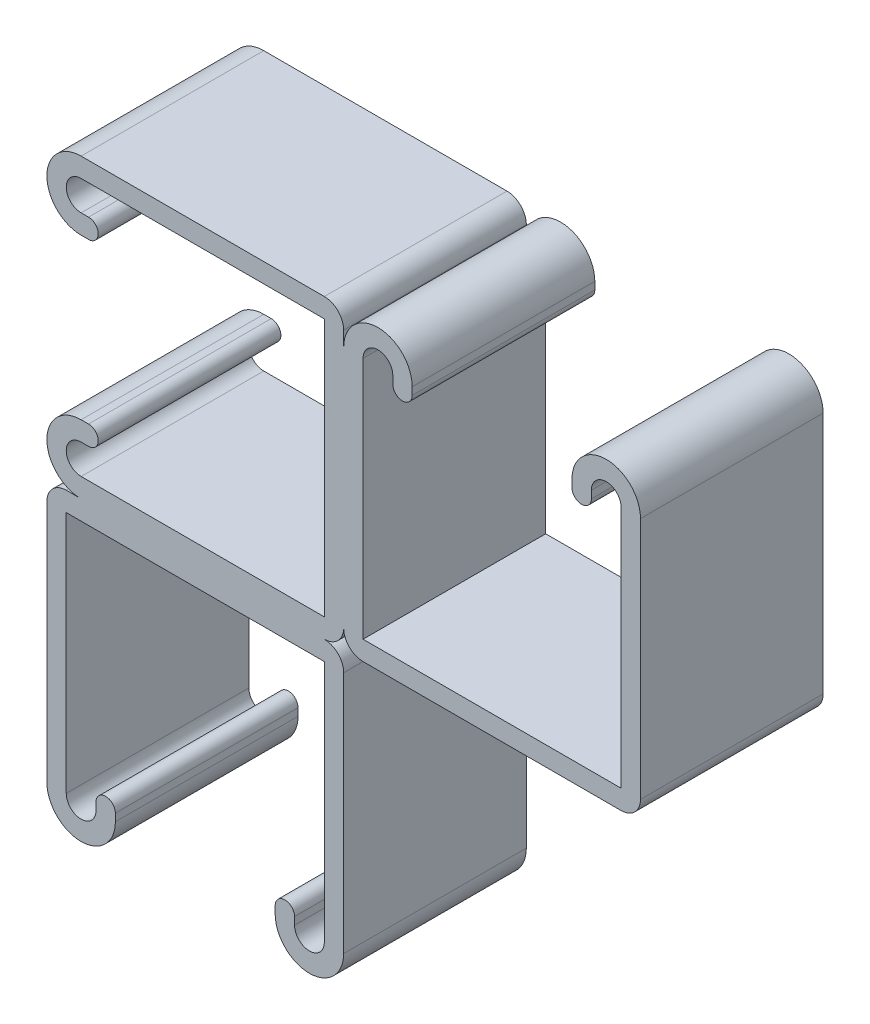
ISO-10303-21;
HEADER;
FILE_DESCRIPTION(('STEP AP214'),'2;1');
FILE_NAME('part.step','',(''),(''),'','','');
FILE_SCHEMA(('AUTOMOTIVE_DESIGN { 1 0 10303 214 1 1 1 1 }'));
ENDSEC;
DATA;
#1=APPLICATION_CONTEXT('core data for automotive mechanical design processes');
#2=APPLICATION_PROTOCOL_DEFINITION('international standard','automotive_design',2000,#1);
#3=PRODUCT_CONTEXT('',#1,'mechanical');
#4=PRODUCT('Part','Part','',(#3));
#5=PRODUCT_RELATED_PRODUCT_CATEGORY('part','',(#4));
#6=PRODUCT_DEFINITION_FORMATION('','',#4);
#7=PRODUCT_DEFINITION_CONTEXT('part definition',#1,'design');
#8=PRODUCT_DEFINITION('design','',#6,#7);
#9=PRODUCT_DEFINITION_SHAPE('','',#8);
#10=(LENGTH_UNIT() NAMED_UNIT(*) SI_UNIT(.MILLI.,.METRE.));
#11=(NAMED_UNIT(*) PLANE_ANGLE_UNIT() SI_UNIT($,.RADIAN.));
#12=(NAMED_UNIT(*) SI_UNIT($,.STERADIAN.) SOLID_ANGLE_UNIT());
#13=UNCERTAINTY_MEASURE_WITH_UNIT(LENGTH_MEASURE(1.E-05),#10,'distance_accuracy_value','');
#14=(GEOMETRIC_REPRESENTATION_CONTEXT(3) GLOBAL_UNCERTAINTY_ASSIGNED_CONTEXT((#13)) GLOBAL_UNIT_ASSIGNED_CONTEXT((#10,
#11,#12)) REPRESENTATION_CONTEXT('',''));
#15=CARTESIAN_POINT('',(0.,0.,0.));
#16=DIRECTION('',(0.,0.,1.));
#17=DIRECTION('',(1.,0.,0.));
#18=AXIS2_PLACEMENT_3D('',#15,#16,#17);
#19=CARTESIAN_POINT('',(4.7625,36.5125,12.7));
#20=DIRECTION('',(0.,0.,-1.));
#21=DIRECTION('',(-1.,0.,0.));
#22=AXIS2_PLACEMENT_3D('',#19,#20,#21);
#23=CYLINDRICAL_SURFACE('',#22,4.7625);
#24=CARTESIAN_POINT('',(4.7625,36.5125,-12.7));
#25=DIRECTION('',(0.,0.,1.));
#26=DIRECTION('',(-1.,0.,0.));
#27=AXIS2_PLACEMENT_3D('',#24,#25,#26);
#28=CIRCLE('',#27,4.7625);
#29=CARTESIAN_POINT('',(9.525,36.5125,-12.7));
#30=VERTEX_POINT('',#29);
#31=CARTESIAN_POINT('',(0.,36.5125,-12.7));
#32=VERTEX_POINT('',#31);
#33=EDGE_CURVE('E207',#30,#32,#28,.T.);
#34=ORIENTED_EDGE('',*,*,#33,.T.);
#35=DIRECTION('',(0.,0.,-1.));
#36=VECTOR('',#35,1.);
#37=CARTESIAN_POINT('',(0.,36.5125,12.7));
#38=LINE('',#37,#36);
#39=CARTESIAN_POINT('',(0.,36.5125,12.7));
#40=VERTEX_POINT('',#39);
#41=EDGE_CURVE('E11',#40,#32,#38,.T.);
#42=ORIENTED_EDGE('',*,*,#41,.F.);
#43=CARTESIAN_POINT('',(4.7625,36.5125,12.7));
#44=DIRECTION('',(0.,0.,1.));
#45=DIRECTION('',(-1.,0.,0.));
#46=AXIS2_PLACEMENT_3D('',#43,#44,#45);
#47=CIRCLE('',#46,4.7625);
#48=CARTESIAN_POINT('',(9.525,36.5125,12.7));
#49=VERTEX_POINT('',#48);
#50=EDGE_CURVE('E126',#49,#40,#47,.T.);
#51=ORIENTED_EDGE('',*,*,#50,.F.);
#52=DIRECTION('',(0.,0.,-1.));
#53=VECTOR('',#52,1.);
#54=CARTESIAN_POINT('',(9.525,36.5125,12.7));
#55=LINE('',#54,#53);
#56=EDGE_CURVE('E205',#49,#30,#55,.T.);
#57=ORIENTED_EDGE('',*,*,#56,.T.);
#58=EDGE_LOOP('',(#34,#42,#51,#57));
#59=FACE_BOUND('',#58,.T.);
#60=ADVANCED_FACE('F41',(#59),#23,.T.);
#61=CARTESIAN_POINT('',(2.6924,2.6924,12.7));
#62=DIRECTION('',(0.,0.,-1.));
#63=DIRECTION('',(-1.,0.,0.));
#64=AXIS2_PLACEMENT_3D('',#61,#62,#63);
#65=CYLINDRICAL_SURFACE('',#64,2.6924);
#66=CARTESIAN_POINT('',(2.6924,2.6924,-12.7));
#67=DIRECTION('',(0.,0.,1.));
#68=DIRECTION('',(-1.,0.,0.));
#69=AXIS2_PLACEMENT_3D('',#66,#67,#68);
#70=CIRCLE('',#69,2.6924);
#71=CARTESIAN_POINT('',(0.,2.6924,-12.7));
#72=VERTEX_POINT('',#71);
#73=CARTESIAN_POINT('',(2.6924,0.,-12.7));
#74=VERTEX_POINT('',#73);
#75=EDGE_CURVE('E209',#72,#74,#70,.T.);
#76=ORIENTED_EDGE('',*,*,#75,.T.);
#77=DIRECTION('',(0.,0.,-1.));
#78=VECTOR('',#77,1.);
#79=CARTESIAN_POINT('',(2.6924,0.,12.7));
#80=LINE('',#79,#78);
#81=CARTESIAN_POINT('',(2.6924,0.,12.7));
#82=VERTEX_POINT('',#81);
#83=EDGE_CURVE('E303',#82,#74,#80,.T.);
#84=ORIENTED_EDGE('',*,*,#83,.F.);
#85=CARTESIAN_POINT('',(2.6924,2.6924,12.7));
#86=DIRECTION('',(0.,0.,1.));
#87=DIRECTION('',(-1.,0.,0.));
#88=AXIS2_PLACEMENT_3D('',#85,#86,#87);
#89=CIRCLE('',#88,2.6924);
#90=CARTESIAN_POINT('',(0.,2.6924,12.7));
#91=VERTEX_POINT('',#90);
#92=EDGE_CURVE('E317',#91,#82,#89,.T.);
#93=ORIENTED_EDGE('',*,*,#92,.F.);
#94=DIRECTION('',(0.,0.,-1.));
#95=VECTOR('',#94,1.);
#96=CARTESIAN_POINT('',(0.,2.6924,12.7));
#97=LINE('',#96,#95);
#98=EDGE_CURVE('E49',#91,#72,#97,.T.);
#99=ORIENTED_EDGE('',*,*,#98,.T.);
#100=EDGE_LOOP('',(#76,#84,#93,#99));
#101=FACE_BOUND('',#100,.T.);
#102=ADVANCED_FACE('F312',(#101),#65,.T.);
#103=CARTESIAN_POINT('',(2.6924,0.,12.7));
#104=DIRECTION('',(0.,1.,0.));
#105=DIRECTION('',(0.,0.,1.));
#106=AXIS2_PLACEMENT_3D('',#103,#104,#105);
#107=PLANE('',#106);
#108=DIRECTION('',(1.,0.,0.));
#109=VECTOR('',#108,1.);
#110=CARTESIAN_POINT('',(2.6924,0.,-12.7));
#111=LINE('',#110,#109);
#112=CARTESIAN_POINT('',(38.5826,0.,-12.7));
#113=VERTEX_POINT('',#112);
#114=EDGE_CURVE('E215',#74,#113,#111,.T.);
#115=ORIENTED_EDGE('',*,*,#114,.T.);
#116=DIRECTION('',(0.,0.,-1.));
#117=VECTOR('',#116,1.);
#118=CARTESIAN_POINT('',(38.5826,0.,12.7));
#119=LINE('',#118,#117);
#120=CARTESIAN_POINT('',(38.5826,0.,12.7));
#121=VERTEX_POINT('',#120);
#122=EDGE_CURVE('E299',#121,#113,#119,.T.);
#123=ORIENTED_EDGE('',*,*,#122,.F.);
#124=DIRECTION('',(1.,0.,0.));
#125=VECTOR('',#124,1.);
#126=CARTESIAN_POINT('',(2.6924,0.,12.7));
#127=LINE('',#126,#125);
#128=EDGE_CURVE('E477',#82,#121,#127,.T.);
#129=ORIENTED_EDGE('',*,*,#128,.F.);
#130=ORIENTED_EDGE('',*,*,#83,.T.);
#131=EDGE_LOOP('',(#115,#123,#129,#130));
#132=FACE_BOUND('',#131,.T.);
#133=ADVANCED_FACE('F1094',(#132),#107,.F.);
#134=CARTESIAN_POINT('',(38.5826,2.6924,12.7));
#135=DIRECTION('',(0.,0.,-1.));
#136=DIRECTION('',(-1.,0.,0.));
#137=AXIS2_PLACEMENT_3D('',#134,#135,#136);
#138=CYLINDRICAL_SURFACE('',#137,2.6924);
#139=CARTESIAN_POINT('',(38.5826,2.6924,-12.7));
#140=DIRECTION('',(0.,0.,1.));
#141=DIRECTION('',(1.,0.,0.));
#142=AXIS2_PLACEMENT_3D('',#139,#140,#141);
#143=CIRCLE('',#142,2.6924);
#144=CARTESIAN_POINT('',(41.275,2.6924,-12.7));
#145=VERTEX_POINT('',#144);
#146=EDGE_CURVE('E217',#113,#145,#143,.T.);
#147=ORIENTED_EDGE('',*,*,#146,.T.);
#148=DIRECTION('',(0.,0.,-1.));
#149=VECTOR('',#148,1.);
#150=CARTESIAN_POINT('',(41.275,2.6924,12.7));
#151=LINE('',#150,#149);
#152=CARTESIAN_POINT('',(41.275,2.6924,12.7));
#153=VERTEX_POINT('',#152);
#154=EDGE_CURVE('E294',#153,#145,#151,.T.);
#155=ORIENTED_EDGE('',*,*,#154,.F.);
#156=CARTESIAN_POINT('',(38.5826,2.6924,12.7));
#157=DIRECTION('',(0.,0.,1.));
#158=DIRECTION('',(1.,0.,0.));
#159=AXIS2_PLACEMENT_3D('',#156,#157,#158);
#160=CIRCLE('',#159,2.6924);
#161=EDGE_CURVE('E479',#121,#153,#160,.T.);
#162=ORIENTED_EDGE('',*,*,#161,.F.);
#163=ORIENTED_EDGE('',*,*,#122,.T.);
#164=EDGE_LOOP('',(#147,#155,#162,#163));
#165=FACE_BOUND('',#164,.T.);
#166=ADVANCED_FACE('F1098',(#165),#138,.T.);
#167=CARTESIAN_POINT('',(41.275,2.6924,12.7));
#168=DIRECTION('',(-1.,0.,0.));
#169=DIRECTION('',(0.,0.,1.));
#170=AXIS2_PLACEMENT_3D('',#167,#168,#169);
#171=PLANE('',#170);
#172=DIRECTION('',(0.,1.,0.));
#173=VECTOR('',#172,1.);
#174=CARTESIAN_POINT('',(41.275,2.6924,-12.7));
#175=LINE('',#174,#173);
#176=CARTESIAN_POINT('',(41.275,36.5125,-12.7));
#177=VERTEX_POINT('',#176);
#178=EDGE_CURVE('E219',#145,#177,#175,.T.);
#179=ORIENTED_EDGE('',*,*,#178,.T.);
#180=DIRECTION('',(0.,0.,-1.));
#181=VECTOR('',#180,1.);
#182=CARTESIAN_POINT('',(41.275,36.5125,12.7));
#183=LINE('',#182,#181);
#184=CARTESIAN_POINT('',(41.275,36.5125,12.7));
#185=VERTEX_POINT('',#184);
#186=EDGE_CURVE('E293',#185,#177,#183,.T.);
#187=ORIENTED_EDGE('',*,*,#186,.F.);
#188=DIRECTION('',(0.,1.,0.));
#189=VECTOR('',#188,1.);
#190=CARTESIAN_POINT('',(41.275,2.6924,12.7));
#191=LINE('',#190,#189);
#192=EDGE_CURVE('E485',#153,#185,#191,.T.);
#193=ORIENTED_EDGE('',*,*,#192,.F.);
#194=ORIENTED_EDGE('',*,*,#154,.T.);
#195=EDGE_LOOP('',(#179,#187,#193,#194));
#196=FACE_BOUND('',#195,.T.);
#197=ADVANCED_FACE('F1107',(#196),#171,.F.);
#198=CARTESIAN_POINT('',(36.5125,36.5125,12.7));
#199=DIRECTION('',(0.,0.,-1.));
#200=DIRECTION('',(-1.,0.,0.));
#201=AXIS2_PLACEMENT_3D('',#198,#199,#200);
#202=CYLINDRICAL_SURFACE('',#201,4.7625);
#203=CARTESIAN_POINT('',(36.5125,36.5125,-12.7));
#204=DIRECTION('',(0.,0.,1.));
#205=DIRECTION('',(1.,0.,0.));
#206=AXIS2_PLACEMENT_3D('',#203,#204,#205);
#207=CIRCLE('',#206,4.7625);
#208=CARTESIAN_POINT('',(31.75,36.5125,-12.7));
#209=VERTEX_POINT('',#208);
#210=EDGE_CURVE('E225',#177,#209,#207,.T.);
#211=ORIENTED_EDGE('',*,*,#210,.T.);
#212=DIRECTION('',(0.,0.,-1.));
#213=VECTOR('',#212,1.);
#214=CARTESIAN_POINT('',(31.75,36.5125,12.7));
#215=LINE('',#214,#213);
#216=CARTESIAN_POINT('',(31.75,36.5125,12.7));
#217=VERTEX_POINT('',#216);
#218=EDGE_CURVE('E290',#217,#209,#215,.T.);
#219=ORIENTED_EDGE('',*,*,#218,.F.);
#220=CARTESIAN_POINT('',(36.5125,36.5125,12.7));
#221=DIRECTION('',(0.,0.,1.));
#222=DIRECTION('',(1.,0.,0.));
#223=AXIS2_PLACEMENT_3D('',#220,#221,#222);
#224=CIRCLE('',#223,4.7625);
#225=EDGE_CURVE('E483',#185,#217,#224,.T.);
#226=ORIENTED_EDGE('',*,*,#225,.F.);
#227=ORIENTED_EDGE('',*,*,#186,.T.);
#228=EDGE_LOOP('',(#211,#219,#226,#227));
#229=FACE_BOUND('',#228,.T.);
#230=ADVANCED_FACE('F1106',(#229),#202,.T.);
#231=CARTESIAN_POINT('',(31.75,36.5125,12.7));
#232=DIRECTION('',(1.,0.,0.));
#233=DIRECTION('',(0.,0.,-1.));
#234=AXIS2_PLACEMENT_3D('',#231,#232,#233);
#235=PLANE('',#234);
#236=DIRECTION('',(0.,-1.,0.));
#237=VECTOR('',#236,1.);
#238=CARTESIAN_POINT('',(31.75,36.5125,-12.7));
#239=LINE('',#238,#237);
#240=CARTESIAN_POINT('',(31.75,35.47745,-12.7));
#241=VERTEX_POINT('',#240);
#242=EDGE_CURVE('E223',#209,#241,#239,.T.);
#243=ORIENTED_EDGE('',*,*,#242,.T.);
#244=DIRECTION('',(0.,0.,-1.));
#245=VECTOR('',#244,1.);
#246=CARTESIAN_POINT('',(31.75,35.47745,12.7));
#247=LINE('',#246,#245);
#248=CARTESIAN_POINT('',(31.75,35.47745,12.7));
#249=VERTEX_POINT('',#248);
#250=EDGE_CURVE('E283',#249,#241,#247,.T.);
#251=ORIENTED_EDGE('',*,*,#250,.F.);
#252=DIRECTION('',(0.,-1.,0.));
#253=VECTOR('',#252,1.);
#254=CARTESIAN_POINT('',(31.75,36.5125,12.7));
#255=LINE('',#254,#253);
#256=EDGE_CURVE('E486',#217,#249,#255,.T.);
#257=ORIENTED_EDGE('',*,*,#256,.F.);
#258=ORIENTED_EDGE('',*,*,#218,.T.);
#259=EDGE_LOOP('',(#243,#251,#257,#258));
#260=FACE_BOUND('',#259,.T.);
#261=ADVANCED_FACE('F1111',(#260),#235,.F.);
#262=CARTESIAN_POINT('',(33.0962,35.47745,12.7));
#263=DIRECTION('',(0.,0.,-1.));
#264=DIRECTION('',(-1.,0.,0.));
#265=AXIS2_PLACEMENT_3D('',#262,#263,#264);
#266=CYLINDRICAL_SURFACE('',#265,1.3462);
#267=CARTESIAN_POINT('',(33.0962,35.47745,-12.7));
#268=DIRECTION('',(0.,0.,1.));
#269=DIRECTION('',(1.,0.,0.));
#270=AXIS2_PLACEMENT_3D('',#267,#268,#269);
#271=CIRCLE('',#270,1.3462);
#272=CARTESIAN_POINT('',(34.4424,35.47745,-12.7));
#273=VERTEX_POINT('',#272);
#274=EDGE_CURVE('E226',#241,#273,#271,.T.);
#275=ORIENTED_EDGE('',*,*,#274,.T.);
#276=DIRECTION('',(0.,0.,-1.));
#277=VECTOR('',#276,1.);
#278=CARTESIAN_POINT('',(34.4424,35.47745,12.7));
#279=LINE('',#278,#277);
#280=CARTESIAN_POINT('',(34.4424,35.47745,12.7));
#281=VERTEX_POINT('',#280);
#282=EDGE_CURVE('E278',#281,#273,#279,.T.);
#283=ORIENTED_EDGE('',*,*,#282,.F.);
#284=CARTESIAN_POINT('',(33.0962,35.47745,12.7));
#285=DIRECTION('',(0.,0.,1.));
#286=DIRECTION('',(1.,0.,0.));
#287=AXIS2_PLACEMENT_3D('',#284,#285,#286);
#288=CIRCLE('',#287,1.3462);
#289=EDGE_CURVE('E493',#249,#281,#288,.T.);
#290=ORIENTED_EDGE('',*,*,#289,.F.);
#291=ORIENTED_EDGE('',*,*,#250,.T.);
#292=EDGE_LOOP('',(#275,#283,#290,#291));
#293=FACE_BOUND('',#292,.T.);
#294=ADVANCED_FACE('F1116',(#293),#266,.T.);
#295=CARTESIAN_POINT('',(34.4424,36.5125,12.7));
#296=DIRECTION('',(-1.,0.,0.));
#297=DIRECTION('',(0.,0.,1.));
#298=AXIS2_PLACEMENT_3D('',#295,#296,#297);
#299=PLANE('',#298);
#300=DIRECTION('',(0.,1.,0.));
#301=VECTOR('',#300,1.);
#302=CARTESIAN_POINT('',(34.4424,36.5125,-12.7));
#303=LINE('',#302,#301);
#304=CARTESIAN_POINT('',(34.4424,36.5125,-12.7));
#305=VERTEX_POINT('',#304);
#306=EDGE_CURVE('E233',#273,#305,#303,.T.);
#307=ORIENTED_EDGE('',*,*,#306,.T.);
#308=DIRECTION('',(0.,0.,-1.));
#309=VECTOR('',#308,1.);
#310=CARTESIAN_POINT('',(34.4424,36.5125,12.7));
#311=LINE('',#310,#309);
#312=CARTESIAN_POINT('',(34.4424,36.5125,12.7));
#313=VERTEX_POINT('',#312);
#314=EDGE_CURVE('E273',#313,#305,#311,.T.);
#315=ORIENTED_EDGE('',*,*,#314,.F.);
#316=DIRECTION('',(0.,1.,0.));
#317=VECTOR('',#316,1.);
#318=CARTESIAN_POINT('',(34.4424,36.5125,12.7));
#319=LINE('',#318,#317);
#320=EDGE_CURVE('E494',#281,#313,#319,.T.);
#321=ORIENTED_EDGE('',*,*,#320,.F.);
#322=ORIENTED_EDGE('',*,*,#282,.T.);
#323=EDGE_LOOP('',(#307,#315,#321,#322));
#324=FACE_BOUND('',#323,.T.);
#325=ADVANCED_FACE('F1121',(#324),#299,.F.);
#326=CARTESIAN_POINT('',(36.5125,36.5125,12.7));
#327=DIRECTION('',(0.,0.,-1.));
#328=DIRECTION('',(-1.,0.,0.));
#329=AXIS2_PLACEMENT_3D('',#326,#327,#328);
#330=CYLINDRICAL_SURFACE('',#329,2.0701);
#331=CARTESIAN_POINT('',(36.5125,36.5125,-12.7));
#332=DIRECTION('',(0.,0.,-1.));
#333=DIRECTION('',(1.,0.,0.));
#334=AXIS2_PLACEMENT_3D('',#331,#332,#333);
#335=CIRCLE('',#334,2.0701);
#336=CARTESIAN_POINT('',(38.5826,36.5125,-12.7));
#337=VERTEX_POINT('',#336);
#338=EDGE_CURVE('E234',#305,#337,#335,.T.);
#339=ORIENTED_EDGE('',*,*,#338,.T.);
#340=DIRECTION('',(0.,0.,-1.));
#341=VECTOR('',#340,1.);
#342=CARTESIAN_POINT('',(38.5826,36.5125,12.7));
#343=LINE('',#342,#341);
#344=CARTESIAN_POINT('',(38.5826,36.5125,12.7));
#345=VERTEX_POINT('',#344);
#346=EDGE_CURVE('E272',#345,#337,#343,.T.);
#347=ORIENTED_EDGE('',*,*,#346,.F.);
#348=CARTESIAN_POINT('',(36.5125,36.5125,12.7));
#349=DIRECTION('',(0.,0.,-1.));
#350=DIRECTION('',(1.,0.,0.));
#351=AXIS2_PLACEMENT_3D('',#348,#349,#350);
#352=CIRCLE('',#351,2.0701);
#353=EDGE_CURVE('E500',#313,#345,#352,.T.);
#354=ORIENTED_EDGE('',*,*,#353,.F.);
#355=ORIENTED_EDGE('',*,*,#314,.T.);
#356=EDGE_LOOP('',(#339,#347,#354,#355));
#357=FACE_BOUND('',#356,.T.);
#358=ADVANCED_FACE('F1127',(#357),#330,.F.);
#359=CARTESIAN_POINT('',(38.5826,2.6924,12.7));
#360=DIRECTION('',(1.,0.,0.));
#361=DIRECTION('',(0.,1.,0.));
#362=AXIS2_PLACEMENT_3D('',#359,#360,#361);
#363=PLANE('',#362);
#364=DIRECTION('',(0.,-1.,0.));
#365=VECTOR('',#364,1.);
#366=CARTESIAN_POINT('',(38.5826,2.6924,-12.7));
#367=LINE('',#366,#365);
#368=CARTESIAN_POINT('',(38.5826,2.6924,-12.7));
#369=VERTEX_POINT('',#368);
#370=EDGE_CURVE('E240',#337,#369,#367,.T.);
#371=ORIENTED_EDGE('',*,*,#370,.T.);
#372=DIRECTION('',(0.,0.,-1.));
#373=VECTOR('',#372,1.);
#374=CARTESIAN_POINT('',(38.5826,2.6924,12.7));
#375=LINE('',#374,#373);
#376=CARTESIAN_POINT('',(38.5826,2.6924,12.7));
#377=VERTEX_POINT('',#376);
#378=EDGE_CURVE('E270',#377,#369,#375,.T.);
#379=ORIENTED_EDGE('',*,*,#378,.F.);
#380=DIRECTION('',(0.,-1.,0.));
#381=VECTOR('',#380,1.);
#382=CARTESIAN_POINT('',(38.5826,2.6924,12.7));
#383=LINE('',#382,#381);
#384=EDGE_CURVE('E499',#345,#377,#383,.T.);
#385=ORIENTED_EDGE('',*,*,#384,.F.);
#386=ORIENTED_EDGE('',*,*,#346,.T.);
#387=EDGE_LOOP('',(#371,#379,#385,#386));
#388=FACE_BOUND('',#387,.T.);
#389=ADVANCED_FACE('F1126',(#388),#363,.F.);
#390=CARTESIAN_POINT('',(2.6924,2.6924,12.7));
#391=DIRECTION('',(0.,-1.,0.));
#392=DIRECTION('',(1.,0.,0.));
#393=AXIS2_PLACEMENT_3D('',#390,#391,#392);
#394=PLANE('',#393);
#395=DIRECTION('',(-1.,0.,0.));
#396=VECTOR('',#395,1.);
#397=CARTESIAN_POINT('',(2.6924,2.6924,-12.7));
#398=LINE('',#397,#396);
#399=CARTESIAN_POINT('',(2.6924,2.6924,-12.7));
#400=VERTEX_POINT('',#399);
#401=EDGE_CURVE('E239',#369,#400,#398,.T.);
#402=ORIENTED_EDGE('',*,*,#401,.T.);
#403=DIRECTION('',(0.,0.,-1.));
#404=VECTOR('',#403,1.);
#405=CARTESIAN_POINT('',(2.6924,2.6924,12.7));
#406=LINE('',#405,#404);
#407=CARTESIAN_POINT('',(2.6924,2.6924,12.7));
#408=VERTEX_POINT('',#407);
#409=EDGE_CURVE('E263',#408,#400,#406,.T.);
#410=ORIENTED_EDGE('',*,*,#409,.F.);
#411=DIRECTION('',(-1.,0.,0.));
#412=VECTOR('',#411,1.);
#413=CARTESIAN_POINT('',(2.6924,2.6924,12.7));
#414=LINE('',#413,#412);
#415=EDGE_CURVE('E503',#377,#408,#414,.T.);
#416=ORIENTED_EDGE('',*,*,#415,.F.);
#417=ORIENTED_EDGE('',*,*,#378,.T.);
#418=EDGE_LOOP('',(#402,#410,#416,#417));
#419=FACE_BOUND('',#418,.T.);
#420=ADVANCED_FACE('F1131',(#419),#394,.F.);
#421=CARTESIAN_POINT('',(2.6924,36.5125,12.7));
#422=DIRECTION('',(-1.,0.,0.));
#423=DIRECTION('',(0.,-1.,0.));
#424=AXIS2_PLACEMENT_3D('',#421,#422,#423);
#425=PLANE('',#424);
#426=DIRECTION('',(0.,1.,0.));
#427=VECTOR('',#426,1.);
#428=CARTESIAN_POINT('',(2.6924,36.5125,-12.7));
#429=LINE('',#428,#427);
#430=CARTESIAN_POINT('',(2.6924,36.5125,-12.7));
#431=VERTEX_POINT('',#430);
#432=EDGE_CURVE('E243',#400,#431,#429,.T.);
#433=ORIENTED_EDGE('',*,*,#432,.T.);
#434=DIRECTION('',(0.,0.,-1.));
#435=VECTOR('',#434,1.);
#436=CARTESIAN_POINT('',(2.6924,36.5125,12.7));
#437=LINE('',#436,#435);
#438=CARTESIAN_POINT('',(2.6924,36.5125,12.7));
#439=VERTEX_POINT('',#438);
#440=EDGE_CURVE('E258',#439,#431,#437,.T.);
#441=ORIENTED_EDGE('',*,*,#440,.F.);
#442=DIRECTION('',(0.,1.,0.));
#443=VECTOR('',#442,1.);
#444=CARTESIAN_POINT('',(2.6924,36.5125,12.7));
#445=LINE('',#444,#443);
#446=EDGE_CURVE('E506',#408,#439,#445,.T.);
#447=ORIENTED_EDGE('',*,*,#446,.F.);
#448=ORIENTED_EDGE('',*,*,#409,.T.);
#449=EDGE_LOOP('',(#433,#441,#447,#448));
#450=FACE_BOUND('',#449,.T.);
#451=ADVANCED_FACE('F556',(#450),#425,.F.);
#452=CARTESIAN_POINT('',(4.7625,36.5125,12.7));
#453=DIRECTION('',(0.,0.,-1.));
#454=DIRECTION('',(-1.,0.,0.));
#455=AXIS2_PLACEMENT_3D('',#452,#453,#454);
#456=CYLINDRICAL_SURFACE('',#455,2.0701);
#457=CARTESIAN_POINT('',(4.7625,36.5125,-12.7));
#458=DIRECTION('',(0.,0.,-1.));
#459=DIRECTION('',(-1.,0.,0.));
#460=AXIS2_PLACEMENT_3D('',#457,#458,#459);
#461=CIRCLE('',#460,2.0701);
#462=CARTESIAN_POINT('',(6.8326,36.5125,-12.7));
#463=VERTEX_POINT('',#462);
#464=EDGE_CURVE('E246',#431,#463,#461,.T.);
#465=ORIENTED_EDGE('',*,*,#464,.T.);
#466=DIRECTION('',(0.,0.,-1.));
#467=VECTOR('',#466,1.);
#468=CARTESIAN_POINT('',(6.8326,36.5125,12.7));
#469=LINE('',#468,#467);
#470=CARTESIAN_POINT('',(6.8326,36.5125,12.7));
#471=VERTEX_POINT('',#470);
#472=EDGE_CURVE('E191',#471,#463,#469,.T.);
#473=ORIENTED_EDGE('',*,*,#472,.F.);
#474=CARTESIAN_POINT('',(4.7625,36.5125,12.7));
#475=DIRECTION('',(0.,0.,-1.));
#476=DIRECTION('',(-1.,0.,0.));
#477=AXIS2_PLACEMENT_3D('',#474,#475,#476);
#478=CIRCLE('',#477,2.0701);
#479=EDGE_CURVE('E181',#439,#471,#478,.T.);
#480=ORIENTED_EDGE('',*,*,#479,.F.);
#481=ORIENTED_EDGE('',*,*,#440,.T.);
#482=EDGE_LOOP('',(#465,#473,#480,#481));
#483=FACE_BOUND('',#482,.T.);
#484=ADVANCED_FACE('F565',(#483),#456,.F.);
#485=CARTESIAN_POINT('',(6.8326,36.5125,12.7));
#486=DIRECTION('',(1.,0.,0.));
#487=DIRECTION('',(0.,0.,-1.));
#488=AXIS2_PLACEMENT_3D('',#485,#486,#487);
#489=PLANE('',#488);
#490=DIRECTION('',(0.,-1.,0.));
#491=VECTOR('',#490,1.);
#492=CARTESIAN_POINT('',(6.8326,36.5125,-12.7));
#493=LINE('',#492,#491);
#494=CARTESIAN_POINT('',(6.8326,35.47745,-12.7));
#495=VERTEX_POINT('',#494);
#496=EDGE_CURVE('E188',#463,#495,#493,.T.);
#497=ORIENTED_EDGE('',*,*,#496,.T.);
#498=DIRECTION('',(0.,0.,-1.));
#499=VECTOR('',#498,1.);
#500=CARTESIAN_POINT('',(6.8326,35.47745,12.7));
#501=LINE('',#500,#499);
#502=CARTESIAN_POINT('',(6.8326,35.47745,12.7));
#503=VERTEX_POINT('',#502);
#504=EDGE_CURVE('E190',#503,#495,#501,.T.);
#505=ORIENTED_EDGE('',*,*,#504,.F.);
#506=DIRECTION('',(0.,-1.,0.));
#507=VECTOR('',#506,1.);
#508=CARTESIAN_POINT('',(6.8326,36.5125,12.7));
#509=LINE('',#508,#507);
#510=EDGE_CURVE('E174',#471,#503,#509,.T.);
#511=ORIENTED_EDGE('',*,*,#510,.F.);
#512=ORIENTED_EDGE('',*,*,#472,.T.);
#513=EDGE_LOOP('',(#497,#505,#511,#512));
#514=FACE_BOUND('',#513,.T.);
#515=ADVANCED_FACE('F189',(#514),#489,.F.);
#516=CARTESIAN_POINT('',(8.1788,35.47745,12.7));
#517=DIRECTION('',(0.,0.,-1.));
#518=DIRECTION('',(-1.,0.,0.));
#519=AXIS2_PLACEMENT_3D('',#516,#517,#518);
#520=CYLINDRICAL_SURFACE('',#519,1.3462);
#521=CARTESIAN_POINT('',(8.1788,35.47745,-12.7));
#522=DIRECTION('',(0.,0.,1.));
#523=DIRECTION('',(-1.,0.,0.));
#524=AXIS2_PLACEMENT_3D('',#521,#522,#523);
#525=CIRCLE('',#524,1.3462);
#526=CARTESIAN_POINT('',(9.525,35.47745,-12.7));
#527=VERTEX_POINT('',#526);
#528=EDGE_CURVE('E114',#495,#527,#525,.T.);
#529=ORIENTED_EDGE('',*,*,#528,.T.);
#530=DIRECTION('',(0.,0.,-1.));
#531=VECTOR('',#530,1.);
#532=CARTESIAN_POINT('',(9.525,35.47745,12.7));
#533=LINE('',#532,#531);
#534=CARTESIAN_POINT('',(9.525,35.47745,12.7));
#535=VERTEX_POINT('',#534);
#536=EDGE_CURVE('E195',#535,#527,#533,.T.);
#537=ORIENTED_EDGE('',*,*,#536,.F.);
#538=CARTESIAN_POINT('',(8.1788,35.47745,12.7));
#539=DIRECTION('',(0.,0.,1.));
#540=DIRECTION('',(-1.,0.,0.));
#541=AXIS2_PLACEMENT_3D('',#538,#539,#540);
#542=CIRCLE('',#541,1.3462);
#543=EDGE_CURVE('E177',#503,#535,#542,.T.);
#544=ORIENTED_EDGE('',*,*,#543,.F.);
#545=ORIENTED_EDGE('',*,*,#504,.T.);
#546=EDGE_LOOP('',(#529,#537,#544,#545));
#547=FACE_BOUND('',#546,.T.);
#548=ADVANCED_FACE('F192',(#547),#520,.T.);
#549=CARTESIAN_POINT('',(9.525,36.5125,12.7));
#550=DIRECTION('',(-1.,0.,0.));
#551=DIRECTION('',(0.,-1.,0.));
#552=AXIS2_PLACEMENT_3D('',#549,#550,#551);
#553=PLANE('',#552);
#554=DIRECTION('',(0.,1.,0.));
#555=VECTOR('',#554,1.);
#556=CARTESIAN_POINT('',(9.525,36.5125,-12.7));
#557=LINE('',#556,#555);
#558=EDGE_CURVE('E122',#527,#30,#557,.T.);
#559=ORIENTED_EDGE('',*,*,#558,.T.);
#560=ORIENTED_EDGE('',*,*,#56,.F.);
#561=DIRECTION('',(0.,1.,0.));
#562=VECTOR('',#561,1.);
#563=CARTESIAN_POINT('',(9.525,36.5125,12.7));
#564=LINE('',#563,#562);
#565=EDGE_CURVE('E59',#535,#49,#564,.T.);
#566=ORIENTED_EDGE('',*,*,#565,.F.);
#567=ORIENTED_EDGE('',*,*,#536,.T.);
#568=EDGE_LOOP('',(#559,#560,#566,#567));
#569=FACE_BOUND('',#568,.T.);
#570=ADVANCED_FACE('F1150',(#569),#553,.F.);
#571=CARTESIAN_POINT('',(4.7625,36.5125,12.7));
#572=DIRECTION('',(0.,0.,-1.));
#573=DIRECTION('',(-1.,0.,0.));
#574=AXIS2_PLACEMENT_3D('',#571,#572,#573);
#575=PLANE('',#574);
#576=ORIENTED_EDGE('',*,*,#50,.T.);
#577=DIRECTION('',(0.,1.,0.));
#578=VECTOR('',#577,1.);
#579=CARTESIAN_POINT('',(0.,2.6924,12.7));
#580=LINE('',#579,#578);
#581=CARTESIAN_POINT('',(-1.34710427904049E-13,38.5826,12.7));
#582=VERTEX_POINT('',#581);
#583=EDGE_CURVE('E575',#40,#582,#580,.T.);
#584=ORIENTED_EDGE('',*,*,#583,.T.);
#585=CARTESIAN_POINT('',(-2.69240000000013,38.5826,12.7));
#586=DIRECTION('',(0.,0.,1.));
#587=DIRECTION('',(0.,1.,0.));
#588=AXIS2_PLACEMENT_3D('',#585,#586,#587);
#589=CIRCLE('',#588,2.6924);
#590=CARTESIAN_POINT('',(-2.69240000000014,41.275,12.7));
#591=VERTEX_POINT('',#590);
#592=EDGE_CURVE('E580',#582,#591,#589,.T.);
#593=ORIENTED_EDGE('',*,*,#592,.T.);
#594=DIRECTION('',(-1.,0.,0.));
#595=VECTOR('',#594,1.);
#596=CARTESIAN_POINT('',(-2.69240000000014,41.275,12.7));
#597=LINE('',#596,#595);
#598=CARTESIAN_POINT('',(-36.5125000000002,41.2749999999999,12.7));
#599=VERTEX_POINT('',#598);
#600=EDGE_CURVE('E581',#591,#599,#597,.T.);
#601=ORIENTED_EDGE('',*,*,#600,.T.);
#602=CARTESIAN_POINT('',(-36.5125000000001,36.5124999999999,12.7));
#603=DIRECTION('',(0.,0.,1.));
#604=DIRECTION('',(0.,1.,0.));
#605=AXIS2_PLACEMENT_3D('',#602,#603,#604);
#606=CIRCLE('',#605,4.7625);
#607=CARTESIAN_POINT('',(-36.5125000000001,31.7499999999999,12.7));
#608=VERTEX_POINT('',#607);
#609=EDGE_CURVE('E586',#599,#608,#606,.T.);
#610=ORIENTED_EDGE('',*,*,#609,.T.);
#611=DIRECTION('',(1.,0.,0.));
#612=VECTOR('',#611,1.);
#613=CARTESIAN_POINT('',(-36.5125000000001,31.7499999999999,12.7));
#614=LINE('',#613,#612);
#615=CARTESIAN_POINT('',(-35.4774500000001,31.7499999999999,12.7));
#616=VERTEX_POINT('',#615);
#617=EDGE_CURVE('E591',#608,#616,#614,.T.);
#618=ORIENTED_EDGE('',*,*,#617,.T.);
#619=CARTESIAN_POINT('',(-35.4774500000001,33.0961999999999,12.7));
#620=DIRECTION('',(0.,0.,1.));
#621=DIRECTION('',(0.,1.,0.));
#622=AXIS2_PLACEMENT_3D('',#619,#620,#621);
#623=CIRCLE('',#622,1.3462);
#624=CARTESIAN_POINT('',(-35.4774500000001,34.4423999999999,12.7));
#625=VERTEX_POINT('',#624);
#626=EDGE_CURVE('E596',#616,#625,#623,.T.);
#627=ORIENTED_EDGE('',*,*,#626,.T.);
#628=DIRECTION('',(-1.,0.,0.));
#629=VECTOR('',#628,1.);
#630=CARTESIAN_POINT('',(-36.5125000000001,34.4423999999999,12.7));
#631=LINE('',#630,#629);
#632=CARTESIAN_POINT('',(-36.5125000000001,34.4423999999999,12.7));
#633=VERTEX_POINT('',#632);
#634=EDGE_CURVE('E601',#625,#633,#631,.T.);
#635=ORIENTED_EDGE('',*,*,#634,.T.);
#636=CARTESIAN_POINT('',(-36.5125000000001,36.5124999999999,12.7));
#637=DIRECTION('',(0.,0.,-1.));
#638=DIRECTION('',(0.,1.,0.));
#639=AXIS2_PLACEMENT_3D('',#636,#637,#638);
#640=CIRCLE('',#639,2.0701);
#641=CARTESIAN_POINT('',(-36.5125000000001,38.5825999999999,12.7));
#642=VERTEX_POINT('',#641);
#643=EDGE_CURVE('E607',#633,#642,#640,.T.);
#644=ORIENTED_EDGE('',*,*,#643,.T.);
#645=DIRECTION('',(1.,0.,0.));
#646=VECTOR('',#645,1.);
#647=CARTESIAN_POINT('',(-2.69240000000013,38.5826,12.7));
#648=LINE('',#647,#646);
#649=CARTESIAN_POINT('',(-2.69240000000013,38.5826,12.7));
#650=VERTEX_POINT('',#649);
#651=EDGE_CURVE('E606',#642,#650,#648,.T.);
#652=ORIENTED_EDGE('',*,*,#651,.T.);
#653=DIRECTION('',(0.,-1.,0.));
#654=VECTOR('',#653,1.);
#655=CARTESIAN_POINT('',(-2.69240000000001,2.69239999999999,12.7));
#656=LINE('',#655,#654);
#657=CARTESIAN_POINT('',(-2.69240000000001,2.69239999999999,12.7));
#658=VERTEX_POINT('',#657);
#659=EDGE_CURVE('E611',#650,#658,#656,.T.);
#660=ORIENTED_EDGE('',*,*,#659,.T.);
#661=DIRECTION('',(-1.,0.,0.));
#662=VECTOR('',#661,1.);
#663=CARTESIAN_POINT('',(-36.5125,2.69239999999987,12.7));
#664=LINE('',#663,#662);
#665=CARTESIAN_POINT('',(-36.5125,2.69239999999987,12.7));
#666=VERTEX_POINT('',#665);
#667=EDGE_CURVE('E616',#658,#666,#664,.T.);
#668=ORIENTED_EDGE('',*,*,#667,.T.);
#669=CARTESIAN_POINT('',(-36.5125,4.76249999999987,12.7));
#670=DIRECTION('',(0.,0.,-1.));
#671=DIRECTION('',(0.,-1.,0.));
#672=AXIS2_PLACEMENT_3D('',#669,#670,#671);
#673=CIRCLE('',#672,2.0701);
#674=CARTESIAN_POINT('',(-36.5125,6.83259999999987,12.7));
#675=VERTEX_POINT('',#674);
#676=EDGE_CURVE('E625',#666,#675,#673,.T.);
#677=ORIENTED_EDGE('',*,*,#676,.T.);
#678=DIRECTION('',(1.,0.,0.));
#679=VECTOR('',#678,1.);
#680=CARTESIAN_POINT('',(-36.5125,6.83259999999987,12.7));
#681=LINE('',#680,#679);
#682=CARTESIAN_POINT('',(-35.47745,6.83259999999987,12.7));
#683=VERTEX_POINT('',#682);
#684=EDGE_CURVE('E626',#675,#683,#681,.T.);
#685=ORIENTED_EDGE('',*,*,#684,.T.);
#686=CARTESIAN_POINT('',(-35.47745,8.17879999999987,12.7));
#687=DIRECTION('',(0.,0.,1.));
#688=DIRECTION('',(0.,-1.,0.));
#689=AXIS2_PLACEMENT_3D('',#686,#687,#688);
#690=CIRCLE('',#689,1.3462);
#691=CARTESIAN_POINT('',(-35.47745,9.52499999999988,12.7));
#692=VERTEX_POINT('',#691);
#693=EDGE_CURVE('E629',#683,#692,#690,.T.);
#694=ORIENTED_EDGE('',*,*,#693,.T.);
#695=DIRECTION('',(-1.,0.,0.));
#696=VECTOR('',#695,1.);
#697=CARTESIAN_POINT('',(-36.5125,9.52499999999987,12.7));
#698=LINE('',#697,#696);
#699=CARTESIAN_POINT('',(-36.5125,9.52499999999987,12.7));
#700=VERTEX_POINT('',#699);
#701=EDGE_CURVE('E412',#692,#700,#698,.T.);
#702=ORIENTED_EDGE('',*,*,#701,.T.);
#703=CARTESIAN_POINT('',(-36.5125,4.76249999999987,12.7));
#704=DIRECTION('',(0.,0.,1.));
#705=DIRECTION('',(0.,-1.,0.));
#706=AXIS2_PLACEMENT_3D('',#703,#704,#705);
#707=CIRCLE('',#706,4.7625);
#708=CARTESIAN_POINT('',(-36.5125,-1.30084797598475E-13,12.7));
#709=VERTEX_POINT('',#708);
#710=EDGE_CURVE('E403',#700,#709,#707,.T.);
#711=ORIENTED_EDGE('',*,*,#710,.T.);
#712=DIRECTION('',(-1.,0.,0.));
#713=VECTOR('',#712,1.);
#714=CARTESIAN_POINT('',(-2.6924,0.,12.7));
#715=LINE('',#714,#713);
#716=CARTESIAN_POINT('',(-38.5826,-2.69420855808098E-13,12.7));
#717=VERTEX_POINT('',#716);
#718=EDGE_CURVE('E855',#709,#717,#715,.T.);
#719=ORIENTED_EDGE('',*,*,#718,.T.);
#720=CARTESIAN_POINT('',(-38.5826,-2.69240000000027,12.7));
#721=DIRECTION('',(0.,0.,1.));
#722=DIRECTION('',(-1.,0.,0.));
#723=AXIS2_PLACEMENT_3D('',#720,#721,#722);
#724=CIRCLE('',#723,2.6924);
#725=CARTESIAN_POINT('',(-41.275,-2.69240000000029,12.7));
#726=VERTEX_POINT('',#725);
#727=EDGE_CURVE('E848',#717,#726,#724,.T.);
#728=ORIENTED_EDGE('',*,*,#727,.T.);
#729=DIRECTION('',(0.,-1.,0.));
#730=VECTOR('',#729,1.);
#731=CARTESIAN_POINT('',(-41.275,-2.69240000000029,12.7));
#732=LINE('',#731,#730);
#733=CARTESIAN_POINT('',(-41.2749999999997,-36.5125000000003,12.7));
#734=VERTEX_POINT('',#733);
#735=EDGE_CURVE('E843',#726,#734,#732,.T.);
#736=ORIENTED_EDGE('',*,*,#735,.T.);
#737=CARTESIAN_POINT('',(-36.5124999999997,-36.5125000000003,12.7));
#738=DIRECTION('',(0.,0.,1.));
#739=DIRECTION('',(-1.,0.,0.));
#740=AXIS2_PLACEMENT_3D('',#737,#738,#739);
#741=CIRCLE('',#740,4.7625);
#742=CARTESIAN_POINT('',(-31.7499999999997,-36.5125000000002,12.7));
#743=VERTEX_POINT('',#742);
#744=EDGE_CURVE('E838',#734,#743,#741,.T.);
#745=ORIENTED_EDGE('',*,*,#744,.T.);
#746=DIRECTION('',(0.,1.,0.));
#747=VECTOR('',#746,1.);
#748=CARTESIAN_POINT('',(-31.7499999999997,-36.5125000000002,12.7));
#749=LINE('',#748,#747);
#750=CARTESIAN_POINT('',(-31.7499999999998,-35.4774500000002,12.7));
#751=VERTEX_POINT('',#750);
#752=EDGE_CURVE('E837',#743,#751,#749,.T.);
#753=ORIENTED_EDGE('',*,*,#752,.T.);
#754=CARTESIAN_POINT('',(-33.0961999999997,-35.4774500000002,12.7));
#755=DIRECTION('',(0.,0.,1.));
#756=DIRECTION('',(-1.,0.,0.));
#757=AXIS2_PLACEMENT_3D('',#754,#755,#756);
#758=CIRCLE('',#757,1.3462);
#759=CARTESIAN_POINT('',(-34.4423999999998,-35.4774500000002,12.7));
#760=VERTEX_POINT('',#759);
#761=EDGE_CURVE('E835',#751,#760,#758,.T.);
#762=ORIENTED_EDGE('',*,*,#761,.T.);
#763=DIRECTION('',(0.,-1.,0.));
#764=VECTOR('',#763,1.);
#765=CARTESIAN_POINT('',(-34.4423999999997,-36.5125000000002,12.7));
#766=LINE('',#765,#764);
#767=CARTESIAN_POINT('',(-34.4423999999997,-36.5125000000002,12.7));
#768=VERTEX_POINT('',#767);
#769=EDGE_CURVE('E828',#760,#768,#766,.T.);
#770=ORIENTED_EDGE('',*,*,#769,.T.);
#771=CARTESIAN_POINT('',(-36.5124999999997,-36.5125000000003,12.7));
#772=DIRECTION('',(0.,0.,-1.));
#773=DIRECTION('',(-1.,0.,0.));
#774=AXIS2_PLACEMENT_3D('',#771,#772,#773);
#775=CIRCLE('',#774,2.0701);
#776=CARTESIAN_POINT('',(-38.5825999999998,-36.5125000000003,12.7));
#777=VERTEX_POINT('',#776);
#778=EDGE_CURVE('E822',#768,#777,#775,.T.);
#779=ORIENTED_EDGE('',*,*,#778,.T.);
#780=DIRECTION('',(0.,1.,0.));
#781=VECTOR('',#780,1.);
#782=CARTESIAN_POINT('',(-38.5826,-2.69240000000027,12.7));
#783=LINE('',#782,#781);
#784=CARTESIAN_POINT('',(-38.5826,-2.69240000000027,12.7));
#785=VERTEX_POINT('',#784);
#786=EDGE_CURVE('E817',#777,#785,#783,.T.);
#787=ORIENTED_EDGE('',*,*,#786,.T.);
#788=DIRECTION('',(1.,0.,0.));
#789=VECTOR('',#788,1.);
#790=CARTESIAN_POINT('',(-2.69239999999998,-2.69240000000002,12.7));
#791=LINE('',#790,#789);
#792=CARTESIAN_POINT('',(-2.69239999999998,-2.69240000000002,12.7));
#793=VERTEX_POINT('',#792);
#794=EDGE_CURVE('E818',#785,#793,#791,.T.);
#795=ORIENTED_EDGE('',*,*,#794,.T.);
#796=DIRECTION('',(0.,-1.,0.));
#797=VECTOR('',#796,1.);
#798=CARTESIAN_POINT('',(-2.69239999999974,-36.5125,12.7));
#799=LINE('',#798,#797);
#800=CARTESIAN_POINT('',(-2.69239999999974,-36.5125,12.7));
#801=VERTEX_POINT('',#800);
#802=EDGE_CURVE('E812',#793,#801,#799,.T.);
#803=ORIENTED_EDGE('',*,*,#802,.T.);
#804=CARTESIAN_POINT('',(-4.76249999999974,-36.5125,12.7));
#805=DIRECTION('',(0.,0.,-1.));
#806=DIRECTION('',(1.,0.,0.));
#807=AXIS2_PLACEMENT_3D('',#804,#805,#806);
#808=CIRCLE('',#807,2.0701);
#809=CARTESIAN_POINT('',(-6.83259999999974,-36.5125000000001,12.7));
#810=VERTEX_POINT('',#809);
#811=EDGE_CURVE('E809',#801,#810,#808,.T.);
#812=ORIENTED_EDGE('',*,*,#811,.T.);
#813=DIRECTION('',(0.,1.,0.));
#814=VECTOR('',#813,1.);
#815=CARTESIAN_POINT('',(-6.83259999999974,-36.5125000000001,12.7));
#816=LINE('',#815,#814);
#817=CARTESIAN_POINT('',(-6.83259999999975,-35.47745,12.7));
#818=VERTEX_POINT('',#817);
#819=EDGE_CURVE('E804',#810,#818,#816,.T.);
#820=ORIENTED_EDGE('',*,*,#819,.T.);
#821=CARTESIAN_POINT('',(-8.17879999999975,-35.4774500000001,12.7));
#822=DIRECTION('',(0.,0.,1.));
#823=DIRECTION('',(1.,0.,0.));
#824=AXIS2_PLACEMENT_3D('',#821,#822,#823);
#825=CIRCLE('',#824,1.3462);
#826=CARTESIAN_POINT('',(-9.52499999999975,-35.4774500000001,12.7));
#827=VERTEX_POINT('',#826);
#828=EDGE_CURVE('E797',#818,#827,#825,.T.);
#829=ORIENTED_EDGE('',*,*,#828,.T.);
#830=DIRECTION('',(0.,-1.,0.));
#831=VECTOR('',#830,1.);
#832=CARTESIAN_POINT('',(-9.52499999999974,-36.5125000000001,12.7));
#833=LINE('',#832,#831);
#834=CARTESIAN_POINT('',(-9.52499999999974,-36.5125000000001,12.7));
#835=VERTEX_POINT('',#834);
#836=EDGE_CURVE('E723',#827,#835,#833,.T.);
#837=ORIENTED_EDGE('',*,*,#836,.T.);
#838=CARTESIAN_POINT('',(-4.76249999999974,-36.5125,12.7));
#839=DIRECTION('',(0.,0.,1.));
#840=DIRECTION('',(1.,0.,0.));
#841=AXIS2_PLACEMENT_3D('',#838,#839,#840);
#842=CIRCLE('',#841,4.7625);
#843=CARTESIAN_POINT('',(2.57567509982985E-13,-36.5125,12.7));
#844=VERTEX_POINT('',#843);
#845=EDGE_CURVE('E728',#835,#844,#842,.T.);
#846=ORIENTED_EDGE('',*,*,#845,.T.);
#847=DIRECTION('',(0.,1.,0.));
#848=VECTOR('',#847,1.);
#849=CARTESIAN_POINT('',(2.57567509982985E-13,-36.5125,12.7));
#850=LINE('',#849,#848);
#851=CARTESIAN_POINT('',(0.,-2.6924,12.7));
#852=VERTEX_POINT('',#851);
#853=EDGE_CURVE('E856',#844,#852,#850,.T.);
#854=ORIENTED_EDGE('',*,*,#853,.T.);
#855=CARTESIAN_POINT('',(-2.69239999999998,-2.69240000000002,12.7));
#856=DIRECTION('',(0.,0.,1.));
#857=DIRECTION('',(1.,0.,0.));
#858=AXIS2_PLACEMENT_3D('',#855,#856,#857);
#859=CIRCLE('',#858,2.6924);
#860=CARTESIAN_POINT('',(-2.6924,0.,12.7));
#861=VERTEX_POINT('',#860);
#862=EDGE_CURVE('E851',#852,#861,#859,.T.);
#863=ORIENTED_EDGE('',*,*,#862,.T.);
#864=CARTESIAN_POINT('',(-2.69240000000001,2.69239999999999,12.7));
#865=DIRECTION('',(0.,0.,1.));
#866=DIRECTION('',(0.,-1.,0.));
#867=AXIS2_PLACEMENT_3D('',#864,#865,#866);
#868=CIRCLE('',#867,2.6924);
#869=EDGE_CURVE('E579',#861,#91,#868,.T.);
#870=ORIENTED_EDGE('',*,*,#869,.T.);
#871=ORIENTED_EDGE('',*,*,#92,.T.);
#872=ORIENTED_EDGE('',*,*,#128,.T.);
#873=ORIENTED_EDGE('',*,*,#161,.T.);
#874=ORIENTED_EDGE('',*,*,#192,.T.);
#875=ORIENTED_EDGE('',*,*,#225,.T.);
#876=ORIENTED_EDGE('',*,*,#256,.T.);
#877=ORIENTED_EDGE('',*,*,#289,.T.);
#878=ORIENTED_EDGE('',*,*,#320,.T.);
#879=ORIENTED_EDGE('',*,*,#353,.T.);
#880=ORIENTED_EDGE('',*,*,#384,.T.);
#881=ORIENTED_EDGE('',*,*,#415,.T.);
#882=ORIENTED_EDGE('',*,*,#446,.T.);
#883=ORIENTED_EDGE('',*,*,#479,.T.);
#884=ORIENTED_EDGE('',*,*,#510,.T.);
#885=ORIENTED_EDGE('',*,*,#543,.T.);
#886=ORIENTED_EDGE('',*,*,#565,.T.);
#887=EDGE_LOOP('',(#576,#584,#593,#601,#610,#618,#627,#635,#644,#652,#660,#668,#677,#685,#694,
#702,#711,#719,#728,#736,#745,#753,#762,#770,#779,#787,#795,#803,#812,#820,#829,#837,#846,#854,
#863,#870,#871,#872,#873,#874,#875,#876,#877,#878,#879,#880,#881,#882,#883,#884,#885,#886));
#888=FACE_BOUND('',#887,.T.);
#889=ADVANCED_FACE('F180',(#888),#575,.F.);
#890=CARTESIAN_POINT('',(4.7625,36.5125,-12.7));
#891=DIRECTION('',(0.,0.,-1.));
#892=DIRECTION('',(-1.,0.,0.));
#893=AXIS2_PLACEMENT_3D('',#890,#891,#892);
#894=PLANE('',#893);
#895=ORIENTED_EDGE('',*,*,#33,.F.);
#896=ORIENTED_EDGE('',*,*,#558,.F.);
#897=ORIENTED_EDGE('',*,*,#528,.F.);
#898=ORIENTED_EDGE('',*,*,#496,.F.);
#899=ORIENTED_EDGE('',*,*,#464,.F.);
#900=ORIENTED_EDGE('',*,*,#432,.F.);
#901=ORIENTED_EDGE('',*,*,#401,.F.);
#902=ORIENTED_EDGE('',*,*,#370,.F.);
#903=ORIENTED_EDGE('',*,*,#338,.F.);
#904=ORIENTED_EDGE('',*,*,#306,.F.);
#905=ORIENTED_EDGE('',*,*,#274,.F.);
#906=ORIENTED_EDGE('',*,*,#242,.F.);
#907=ORIENTED_EDGE('',*,*,#210,.F.);
#908=ORIENTED_EDGE('',*,*,#178,.F.);
#909=ORIENTED_EDGE('',*,*,#146,.F.);
#910=ORIENTED_EDGE('',*,*,#114,.F.);
#911=ORIENTED_EDGE('',*,*,#75,.F.);
#912=CARTESIAN_POINT('',(-2.69240000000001,2.69239999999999,-12.7));
#913=DIRECTION('',(0.,0.,1.));
#914=DIRECTION('',(0.,-1.,0.));
#915=AXIS2_PLACEMENT_3D('',#912,#913,#914);
#916=CIRCLE('',#915,2.6924);
#917=CARTESIAN_POINT('',(-2.6924,0.,-12.7));
#918=VERTEX_POINT('',#917);
#919=EDGE_CURVE('E322',#918,#72,#916,.T.);
#920=ORIENTED_EDGE('',*,*,#919,.F.);
#921=CARTESIAN_POINT('',(-2.69239999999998,-2.69240000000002,-12.7));
#922=DIRECTION('',(0.,0.,1.));
#923=DIRECTION('',(1.,0.,0.));
#924=AXIS2_PLACEMENT_3D('',#921,#922,#923);
#925=CIRCLE('',#924,2.6924);
#926=CARTESIAN_POINT('',(0.,-2.6924,-12.7));
#927=VERTEX_POINT('',#926);
#928=EDGE_CURVE('E790',#927,#918,#925,.T.);
#929=ORIENTED_EDGE('',*,*,#928,.F.);
#930=DIRECTION('',(0.,1.,0.));
#931=VECTOR('',#930,1.);
#932=CARTESIAN_POINT('',(2.57567509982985E-13,-36.5125,-12.7));
#933=LINE('',#932,#931);
#934=CARTESIAN_POINT('',(2.57567509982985E-13,-36.5125,-12.7));
#935=VERTEX_POINT('',#934);
#936=EDGE_CURVE('E786',#935,#927,#933,.T.);
#937=ORIENTED_EDGE('',*,*,#936,.F.);
#938=CARTESIAN_POINT('',(-4.76249999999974,-36.5125,-12.7));
#939=DIRECTION('',(0.,0.,1.));
#940=DIRECTION('',(1.,0.,0.));
#941=AXIS2_PLACEMENT_3D('',#938,#939,#940);
#942=CIRCLE('',#941,4.7625);
#943=CARTESIAN_POINT('',(-9.52499999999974,-36.5125000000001,-12.7));
#944=VERTEX_POINT('',#943);
#945=EDGE_CURVE('E791',#944,#935,#942,.T.);
#946=ORIENTED_EDGE('',*,*,#945,.F.);
#947=DIRECTION('',(0.,-1.,0.));
#948=VECTOR('',#947,1.);
#949=CARTESIAN_POINT('',(-9.52499999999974,-36.5125000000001,-12.7));
#950=LINE('',#949,#948);
#951=CARTESIAN_POINT('',(-9.52499999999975,-35.4774500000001,-12.7));
#952=VERTEX_POINT('',#951);
#953=EDGE_CURVE('E727',#952,#944,#950,.T.);
#954=ORIENTED_EDGE('',*,*,#953,.F.);
#955=CARTESIAN_POINT('',(-8.17879999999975,-35.4774500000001,-12.7));
#956=DIRECTION('',(0.,0.,1.));
#957=DIRECTION('',(1.,0.,0.));
#958=AXIS2_PLACEMENT_3D('',#955,#956,#957);
#959=CIRCLE('',#958,1.3462);
#960=CARTESIAN_POINT('',(-6.83259999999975,-35.47745,-12.7));
#961=VERTEX_POINT('',#960);
#962=EDGE_CURVE('E734',#961,#952,#959,.T.);
#963=ORIENTED_EDGE('',*,*,#962,.F.);
#964=DIRECTION('',(0.,1.,0.));
#965=VECTOR('',#964,1.);
#966=CARTESIAN_POINT('',(-6.83259999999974,-36.5125000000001,-12.7));
#967=LINE('',#966,#965);
#968=CARTESIAN_POINT('',(-6.83259999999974,-36.5125000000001,-12.7));
#969=VERTEX_POINT('',#968);
#970=EDGE_CURVE('E732',#969,#961,#967,.T.);
#971=ORIENTED_EDGE('',*,*,#970,.F.);
#972=CARTESIAN_POINT('',(-4.76249999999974,-36.5125,-12.7));
#973=DIRECTION('',(0.,0.,-1.));
#974=DIRECTION('',(1.,0.,0.));
#975=AXIS2_PLACEMENT_3D('',#972,#973,#974);
#976=CIRCLE('',#975,2.0701);
#977=CARTESIAN_POINT('',(-2.69239999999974,-36.5125,-12.7));
#978=VERTEX_POINT('',#977);
#979=EDGE_CURVE('E739',#978,#969,#976,.T.);
#980=ORIENTED_EDGE('',*,*,#979,.F.);
#981=DIRECTION('',(0.,-1.,0.));
#982=VECTOR('',#981,1.);
#983=CARTESIAN_POINT('',(-2.69239999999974,-36.5125,-12.7));
#984=LINE('',#983,#982);
#985=CARTESIAN_POINT('',(-2.69239999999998,-2.69240000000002,-12.7));
#986=VERTEX_POINT('',#985);
#987=EDGE_CURVE('E744',#986,#978,#984,.T.);
#988=ORIENTED_EDGE('',*,*,#987,.F.);
#989=DIRECTION('',(1.,0.,0.));
#990=VECTOR('',#989,1.);
#991=CARTESIAN_POINT('',(-2.69239999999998,-2.69240000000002,-12.7));
#992=LINE('',#991,#990);
#993=CARTESIAN_POINT('',(-38.5826,-2.69240000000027,-12.7));
#994=VERTEX_POINT('',#993);
#995=EDGE_CURVE('E747',#994,#986,#992,.T.);
#996=ORIENTED_EDGE('',*,*,#995,.F.);
#997=DIRECTION('',(0.,1.,0.));
#998=VECTOR('',#997,1.);
#999=CARTESIAN_POINT('',(-38.5826,-2.69240000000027,-12.7));
#1000=LINE('',#999,#998);
#1001=CARTESIAN_POINT('',(-38.5825999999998,-36.5125000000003,-12.7));
#1002=VERTEX_POINT('',#1001);
#1003=EDGE_CURVE('E753',#1002,#994,#1000,.T.);
#1004=ORIENTED_EDGE('',*,*,#1003,.F.);
#1005=CARTESIAN_POINT('',(-36.5124999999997,-36.5125000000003,-12.7));
#1006=DIRECTION('',(0.,0.,-1.));
#1007=DIRECTION('',(-1.,0.,0.));
#1008=AXIS2_PLACEMENT_3D('',#1005,#1006,#1007);
#1009=CIRCLE('',#1008,2.0701);
#1010=CARTESIAN_POINT('',(-34.4423999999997,-36.5125000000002,-12.7));
#1011=VERTEX_POINT('',#1010);
#1012=EDGE_CURVE('E752',#1011,#1002,#1009,.T.);
#1013=ORIENTED_EDGE('',*,*,#1012,.F.);
#1014=DIRECTION('',(0.,-1.,0.));
#1015=VECTOR('',#1014,1.);
#1016=CARTESIAN_POINT('',(-34.4423999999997,-36.5125000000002,-12.7));
#1017=LINE('',#1016,#1015);
#1018=CARTESIAN_POINT('',(-34.4423999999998,-35.4774500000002,-12.7));
#1019=VERTEX_POINT('',#1018);
#1020=EDGE_CURVE('E757',#1019,#1011,#1017,.T.);
#1021=ORIENTED_EDGE('',*,*,#1020,.F.);
#1022=CARTESIAN_POINT('',(-33.0961999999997,-35.4774500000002,-12.7));
#1023=DIRECTION('',(0.,0.,1.));
#1024=DIRECTION('',(-1.,0.,0.));
#1025=AXIS2_PLACEMENT_3D('',#1022,#1023,#1024);
#1026=CIRCLE('',#1025,1.3462);
#1027=CARTESIAN_POINT('',(-31.7499999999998,-35.4774500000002,-12.7));
#1028=VERTEX_POINT('',#1027);
#1029=EDGE_CURVE('E763',#1028,#1019,#1026,.T.);
#1030=ORIENTED_EDGE('',*,*,#1029,.F.);
#1031=DIRECTION('',(0.,1.,0.));
#1032=VECTOR('',#1031,1.);
#1033=CARTESIAN_POINT('',(-31.7499999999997,-36.5125000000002,-12.7));
#1034=LINE('',#1033,#1032);
#1035=CARTESIAN_POINT('',(-31.7499999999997,-36.5125000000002,-12.7));
#1036=VERTEX_POINT('',#1035);
#1037=EDGE_CURVE('E770',#1036,#1028,#1034,.T.);
#1038=ORIENTED_EDGE('',*,*,#1037,.F.);
#1039=CARTESIAN_POINT('',(-36.5124999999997,-36.5125000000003,-12.7));
#1040=DIRECTION('',(0.,0.,1.));
#1041=DIRECTION('',(-1.,0.,0.));
#1042=AXIS2_PLACEMENT_3D('',#1039,#1040,#1041);
#1043=CIRCLE('',#1042,4.7625);
#1044=CARTESIAN_POINT('',(-41.2749999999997,-36.5125000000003,-12.7));
#1045=VERTEX_POINT('',#1044);
#1046=EDGE_CURVE('E772',#1045,#1036,#1043,.T.);
#1047=ORIENTED_EDGE('',*,*,#1046,.F.);
#1048=DIRECTION('',(0.,-1.,0.));
#1049=VECTOR('',#1048,1.);
#1050=CARTESIAN_POINT('',(-41.275,-2.69240000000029,-12.7));
#1051=LINE('',#1050,#1049);
#1052=CARTESIAN_POINT('',(-41.275,-2.69240000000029,-12.7));
#1053=VERTEX_POINT('',#1052);
#1054=EDGE_CURVE('E773',#1053,#1045,#1051,.T.);
#1055=ORIENTED_EDGE('',*,*,#1054,.F.);
#1056=CARTESIAN_POINT('',(-38.5826,-2.69240000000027,-12.7));
#1057=DIRECTION('',(0.,0.,1.));
#1058=DIRECTION('',(-1.,0.,0.));
#1059=AXIS2_PLACEMENT_3D('',#1056,#1057,#1058);
#1060=CIRCLE('',#1059,2.6924);
#1061=CARTESIAN_POINT('',(-38.5826,-2.69420855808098E-13,-12.7));
#1062=VERTEX_POINT('',#1061);
#1063=EDGE_CURVE('E778',#1062,#1053,#1060,.T.);
#1064=ORIENTED_EDGE('',*,*,#1063,.F.);
#1065=DIRECTION('',(-1.,0.,0.));
#1066=VECTOR('',#1065,1.);
#1067=CARTESIAN_POINT('',(-2.6924,0.,-12.7));
#1068=LINE('',#1067,#1066);
#1069=CARTESIAN_POINT('',(-36.5125,-1.30084797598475E-13,-12.7));
#1070=VERTEX_POINT('',#1069);
#1071=EDGE_CURVE('E783',#1070,#1062,#1068,.T.);
#1072=ORIENTED_EDGE('',*,*,#1071,.F.);
#1073=CARTESIAN_POINT('',(-36.5125,4.76249999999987,-12.7));
#1074=DIRECTION('',(0.,0.,1.));
#1075=DIRECTION('',(0.,-1.,0.));
#1076=AXIS2_PLACEMENT_3D('',#1073,#1074,#1075);
#1077=CIRCLE('',#1076,4.7625);
#1078=CARTESIAN_POINT('',(-36.5125,9.52499999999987,-12.7));
#1079=VERTEX_POINT('',#1078);
#1080=EDGE_CURVE('E333',#1079,#1070,#1077,.T.);
#1081=ORIENTED_EDGE('',*,*,#1080,.F.);
#1082=DIRECTION('',(-1.,0.,0.));
#1083=VECTOR('',#1082,1.);
#1084=CARTESIAN_POINT('',(-36.5125,9.52499999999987,-12.7));
#1085=LINE('',#1084,#1083);
#1086=CARTESIAN_POINT('',(-35.47745,9.52499999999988,-12.7));
#1087=VERTEX_POINT('',#1086);
#1088=EDGE_CURVE('E402',#1087,#1079,#1085,.T.);
#1089=ORIENTED_EDGE('',*,*,#1088,.F.);
#1090=CARTESIAN_POINT('',(-35.47745,8.17879999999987,-12.7));
#1091=DIRECTION('',(0.,0.,1.));
#1092=DIRECTION('',(0.,-1.,0.));
#1093=AXIS2_PLACEMENT_3D('',#1090,#1091,#1092);
#1094=CIRCLE('',#1093,1.3462);
#1095=CARTESIAN_POINT('',(-35.47745,6.83259999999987,-12.7));
#1096=VERTEX_POINT('',#1095);
#1097=EDGE_CURVE('E400',#1096,#1087,#1094,.T.);
#1098=ORIENTED_EDGE('',*,*,#1097,.F.);
#1099=DIRECTION('',(1.,0.,0.));
#1100=VECTOR('',#1099,1.);
#1101=CARTESIAN_POINT('',(-36.5125,6.83259999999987,-12.7));
#1102=LINE('',#1101,#1100);
#1103=CARTESIAN_POINT('',(-36.5125,6.83259999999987,-12.7));
#1104=VERTEX_POINT('',#1103);
#1105=EDGE_CURVE('E393',#1104,#1096,#1102,.T.);
#1106=ORIENTED_EDGE('',*,*,#1105,.F.);
#1107=CARTESIAN_POINT('',(-36.5125,4.76249999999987,-12.7));
#1108=DIRECTION('',(0.,0.,-1.));
#1109=DIRECTION('',(0.,-1.,0.));
#1110=AXIS2_PLACEMENT_3D('',#1107,#1108,#1109);
#1111=CIRCLE('',#1110,2.0701);
#1112=CARTESIAN_POINT('',(-36.5125,2.69239999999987,-12.7));
#1113=VERTEX_POINT('',#1112);
#1114=EDGE_CURVE('E388',#1113,#1104,#1111,.T.);
#1115=ORIENTED_EDGE('',*,*,#1114,.F.);
#1116=DIRECTION('',(-1.,0.,0.));
#1117=VECTOR('',#1116,1.);
#1118=CARTESIAN_POINT('',(-36.5125,2.69239999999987,-12.7));
#1119=LINE('',#1118,#1117);
#1120=CARTESIAN_POINT('',(-2.69240000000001,2.69239999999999,-12.7));
#1121=VERTEX_POINT('',#1120);
#1122=EDGE_CURVE('E383',#1121,#1113,#1119,.T.);
#1123=ORIENTED_EDGE('',*,*,#1122,.F.);
#1124=DIRECTION('',(0.,-1.,0.));
#1125=VECTOR('',#1124,1.);
#1126=CARTESIAN_POINT('',(-2.69240000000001,2.69239999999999,-12.7));
#1127=LINE('',#1126,#1125);
#1128=CARTESIAN_POINT('',(-2.69240000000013,38.5826,-12.7));
#1129=VERTEX_POINT('',#1128);
#1130=EDGE_CURVE('E382',#1129,#1121,#1127,.T.);
#1131=ORIENTED_EDGE('',*,*,#1130,.F.);
#1132=DIRECTION('',(1.,0.,0.));
#1133=VECTOR('',#1132,1.);
#1134=CARTESIAN_POINT('',(-2.69240000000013,38.5826,-12.7));
#1135=LINE('',#1134,#1133);
#1136=CARTESIAN_POINT('',(-36.5125000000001,38.5825999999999,-12.7));
#1137=VERTEX_POINT('',#1136);
#1138=EDGE_CURVE('E380',#1137,#1129,#1135,.T.);
#1139=ORIENTED_EDGE('',*,*,#1138,.F.);
#1140=CARTESIAN_POINT('',(-36.5125000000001,36.5124999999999,-12.7));
#1141=DIRECTION('',(0.,0.,-1.));
#1142=DIRECTION('',(0.,1.,0.));
#1143=AXIS2_PLACEMENT_3D('',#1140,#1141,#1142);
#1144=CIRCLE('',#1143,2.0701);
#1145=CARTESIAN_POINT('',(-36.5125000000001,34.4423999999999,-12.7));
#1146=VERTEX_POINT('',#1145);
#1147=EDGE_CURVE('E373',#1146,#1137,#1144,.T.);
#1148=ORIENTED_EDGE('',*,*,#1147,.F.);
#1149=DIRECTION('',(-1.,0.,0.));
#1150=VECTOR('',#1149,1.);
#1151=CARTESIAN_POINT('',(-36.5125000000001,34.4423999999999,-12.7));
#1152=LINE('',#1151,#1150);
#1153=CARTESIAN_POINT('',(-35.4774500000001,34.4423999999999,-12.7));
#1154=VERTEX_POINT('',#1153);
#1155=EDGE_CURVE('E367',#1154,#1146,#1152,.T.);
#1156=ORIENTED_EDGE('',*,*,#1155,.F.);
#1157=CARTESIAN_POINT('',(-35.4774500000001,33.0961999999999,-12.7));
#1158=DIRECTION('',(0.,0.,1.));
#1159=DIRECTION('',(0.,1.,0.));
#1160=AXIS2_PLACEMENT_3D('',#1157,#1158,#1159);
#1161=CIRCLE('',#1160,1.3462);
#1162=CARTESIAN_POINT('',(-35.4774500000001,31.7499999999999,-12.7));
#1163=VERTEX_POINT('',#1162);
#1164=EDGE_CURVE('E362',#1163,#1154,#1161,.T.);
#1165=ORIENTED_EDGE('',*,*,#1164,.F.);
#1166=DIRECTION('',(1.,0.,0.));
#1167=VECTOR('',#1166,1.);
#1168=CARTESIAN_POINT('',(-36.5125000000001,31.7499999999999,-12.7));
#1169=LINE('',#1168,#1167);
#1170=CARTESIAN_POINT('',(-36.5125000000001,31.7499999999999,-12.7));
#1171=VERTEX_POINT('',#1170);
#1172=EDGE_CURVE('E363',#1171,#1163,#1169,.T.);
#1173=ORIENTED_EDGE('',*,*,#1172,.F.);
#1174=CARTESIAN_POINT('',(-36.5125000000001,36.5124999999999,-12.7));
#1175=DIRECTION('',(0.,0.,1.));
#1176=DIRECTION('',(0.,1.,0.));
#1177=AXIS2_PLACEMENT_3D('',#1174,#1175,#1176);
#1178=CIRCLE('',#1177,4.7625);
#1179=CARTESIAN_POINT('',(-36.5125000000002,41.2749999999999,-12.7));
#1180=VERTEX_POINT('',#1179);
#1181=EDGE_CURVE('E357',#1180,#1171,#1178,.T.);
#1182=ORIENTED_EDGE('',*,*,#1181,.F.);
#1183=DIRECTION('',(-1.,0.,0.));
#1184=VECTOR('',#1183,1.);
#1185=CARTESIAN_POINT('',(-2.69240000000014,41.275,-12.7));
#1186=LINE('',#1185,#1184);
#1187=CARTESIAN_POINT('',(-2.69240000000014,41.275,-12.7));
#1188=VERTEX_POINT('',#1187);
#1189=EDGE_CURVE('E354',#1188,#1180,#1186,.T.);
#1190=ORIENTED_EDGE('',*,*,#1189,.F.);
#1191=CARTESIAN_POINT('',(-2.69240000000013,38.5826,-12.7));
#1192=DIRECTION('',(0.,0.,1.));
#1193=DIRECTION('',(0.,1.,0.));
#1194=AXIS2_PLACEMENT_3D('',#1191,#1192,#1193);
#1195=CIRCLE('',#1194,2.6924);
#1196=CARTESIAN_POINT('',(-1.34710427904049E-13,38.5826,-12.7));
#1197=VERTEX_POINT('',#1196);
#1198=EDGE_CURVE('E341',#1197,#1188,#1195,.T.);
#1199=ORIENTED_EDGE('',*,*,#1198,.F.);
#1200=DIRECTION('',(0.,1.,0.));
#1201=VECTOR('',#1200,1.);
#1202=CARTESIAN_POINT('',(0.,2.6924,-12.7));
#1203=LINE('',#1202,#1201);
#1204=EDGE_CURVE('E331',#32,#1197,#1203,.T.);
#1205=ORIENTED_EDGE('',*,*,#1204,.F.);
#1206=EDGE_LOOP('',(#895,#896,#897,#898,#899,#900,#901,#902,#903,#904,#905,#906,#907,#908,#909,
#910,#911,#920,#929,#937,#946,#954,#963,#971,#980,#988,#996,#1004,#1013,#1021,#1030,#1038,#1047,
#1055,#1064,#1072,#1081,#1089,#1098,#1106,#1115,#1123,#1131,#1139,#1148,#1156,#1165,#1173,#1182,
#1190,#1199,#1205));
#1207=FACE_BOUND('',#1206,.T.);
#1208=ADVANCED_FACE('F562',(#1207),#894,.T.);
#1209=CARTESIAN_POINT('',(0.,2.6924,12.7));
#1210=DIRECTION('',(-1.,0.,0.));
#1211=DIRECTION('',(0.,-1.,0.));
#1212=AXIS2_PLACEMENT_3D('',#1209,#1210,#1211);
#1213=PLANE('',#1212);
#1214=ORIENTED_EDGE('',*,*,#583,.F.);
#1215=ORIENTED_EDGE('',*,*,#41,.T.);
#1216=ORIENTED_EDGE('',*,*,#1204,.T.);
#1217=DIRECTION('',(0.,0.,-1.));
#1218=VECTOR('',#1217,1.);
#1219=CARTESIAN_POINT('',(-1.34710427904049E-13,38.5826,12.7));
#1220=LINE('',#1219,#1218);
#1221=EDGE_CURVE('E464',#582,#1197,#1220,.T.);
#1222=ORIENTED_EDGE('',*,*,#1221,.F.);
#1223=EDGE_LOOP('',(#1214,#1215,#1216,#1222));
#1224=FACE_BOUND('',#1223,.T.);
#1225=ADVANCED_FACE('F569',(#1224),#1213,.F.);
#1226=CARTESIAN_POINT('',(-36.5125,4.76249999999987,12.7));
#1227=DIRECTION('',(0.,0.,-1.));
#1228=DIRECTION('',(-1.,0.,0.));
#1229=AXIS2_PLACEMENT_3D('',#1226,#1227,#1228);
#1230=CYLINDRICAL_SURFACE('',#1229,4.7625);
#1231=ORIENTED_EDGE('',*,*,#1080,.T.);
#1232=DIRECTION('',(0.,0.,-1.));
#1233=VECTOR('',#1232,1.);
#1234=CARTESIAN_POINT('',(-36.5125,-1.30084797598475E-13,12.7));
#1235=LINE('',#1234,#1233);
#1236=EDGE_CURVE('E208',#709,#1070,#1235,.T.);
#1237=ORIENTED_EDGE('',*,*,#1236,.F.);
#1238=ORIENTED_EDGE('',*,*,#710,.F.);
#1239=DIRECTION('',(0.,0.,-1.));
#1240=VECTOR('',#1239,1.);
#1241=CARTESIAN_POINT('',(-36.5125,9.52499999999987,12.7));
#1242=LINE('',#1241,#1240);
#1243=EDGE_CURVE('E409',#700,#1079,#1242,.T.);
#1244=ORIENTED_EDGE('',*,*,#1243,.T.);
#1245=EDGE_LOOP('',(#1231,#1237,#1238,#1244));
#1246=FACE_BOUND('',#1245,.T.);
#1247=ADVANCED_FACE('F653',(#1246),#1230,.T.);
#1248=CARTESIAN_POINT('',(-2.69240000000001,2.69239999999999,12.7));
#1249=DIRECTION('',(0.,0.,-1.));
#1250=DIRECTION('',(-1.,0.,0.));
#1251=AXIS2_PLACEMENT_3D('',#1248,#1249,#1250);
#1252=CYLINDRICAL_SURFACE('',#1251,2.6924);
#1253=ORIENTED_EDGE('',*,*,#919,.T.);
#1254=ORIENTED_EDGE('',*,*,#98,.F.);
#1255=ORIENTED_EDGE('',*,*,#869,.F.);
#1256=DIRECTION('',(0.,0.,-1.));
#1257=VECTOR('',#1256,1.);
#1258=CARTESIAN_POINT('',(-2.6924,0.,12.7));
#1259=LINE('',#1258,#1257);
#1260=EDGE_CURVE('E329',#861,#918,#1259,.T.);
#1261=ORIENTED_EDGE('',*,*,#1260,.T.);
#1262=EDGE_LOOP('',(#1253,#1254,#1255,#1261));
#1263=FACE_BOUND('',#1262,.T.);
#1264=ADVANCED_FACE('F327',(#1263),#1252,.T.);
#1265=CARTESIAN_POINT('',(-2.69240000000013,38.5826,12.7));
#1266=DIRECTION('',(0.,0.,-1.));
#1267=DIRECTION('',(-1.,0.,0.));
#1268=AXIS2_PLACEMENT_3D('',#1265,#1266,#1267);
#1269=CYLINDRICAL_SURFACE('',#1268,2.6924);
#1270=ORIENTED_EDGE('',*,*,#1198,.T.);
#1271=DIRECTION('',(0.,0.,-1.));
#1272=VECTOR('',#1271,1.);
#1273=CARTESIAN_POINT('',(-2.69240000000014,41.275,12.7));
#1274=LINE('',#1273,#1272);
#1275=EDGE_CURVE('E459',#591,#1188,#1274,.T.);
#1276=ORIENTED_EDGE('',*,*,#1275,.F.);
#1277=ORIENTED_EDGE('',*,*,#592,.F.);
#1278=ORIENTED_EDGE('',*,*,#1221,.T.);
#1279=EDGE_LOOP('',(#1270,#1276,#1277,#1278));
#1280=FACE_BOUND('',#1279,.T.);
#1281=ADVANCED_FACE('F1156',(#1280),#1269,.T.);
#1282=CARTESIAN_POINT('',(-2.69240000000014,41.275,12.7));
#1283=DIRECTION('',(0.,-1.,0.));
#1284=DIRECTION('',(1.,0.,0.));
#1285=AXIS2_PLACEMENT_3D('',#1282,#1283,#1284);
#1286=PLANE('',#1285);
#1287=ORIENTED_EDGE('',*,*,#1189,.T.);
#1288=DIRECTION('',(0.,0.,-1.));
#1289=VECTOR('',#1288,1.);
#1290=CARTESIAN_POINT('',(-36.5125000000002,41.2749999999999,12.7));
#1291=LINE('',#1290,#1289);
#1292=EDGE_CURVE('E452',#599,#1180,#1291,.T.);
#1293=ORIENTED_EDGE('',*,*,#1292,.F.);
#1294=ORIENTED_EDGE('',*,*,#600,.F.);
#1295=ORIENTED_EDGE('',*,*,#1275,.T.);
#1296=EDGE_LOOP('',(#1287,#1293,#1294,#1295));
#1297=FACE_BOUND('',#1296,.T.);
#1298=ADVANCED_FACE('F1162',(#1297),#1286,.F.);
#1299=CARTESIAN_POINT('',(-36.5125000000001,36.5124999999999,12.7));
#1300=DIRECTION('',(0.,0.,-1.));
#1301=DIRECTION('',(-1.,0.,0.));
#1302=AXIS2_PLACEMENT_3D('',#1299,#1300,#1301);
#1303=CYLINDRICAL_SURFACE('',#1302,4.7625);
#1304=ORIENTED_EDGE('',*,*,#1181,.T.);
#1305=DIRECTION('',(0.,0.,-1.));
#1306=VECTOR('',#1305,1.);
#1307=CARTESIAN_POINT('',(-36.5125000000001,31.7499999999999,12.7));
#1308=LINE('',#1307,#1306);
#1309=EDGE_CURVE('E454',#608,#1171,#1308,.T.);
#1310=ORIENTED_EDGE('',*,*,#1309,.F.);
#1311=ORIENTED_EDGE('',*,*,#609,.F.);
#1312=ORIENTED_EDGE('',*,*,#1292,.T.);
#1313=EDGE_LOOP('',(#1304,#1310,#1311,#1312));
#1314=FACE_BOUND('',#1313,.T.);
#1315=ADVANCED_FACE('F1163',(#1314),#1303,.T.);
#1316=CARTESIAN_POINT('',(-36.5125000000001,31.7499999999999,12.7));
#1317=DIRECTION('',(0.,1.,0.));
#1318=DIRECTION('',(-1.,0.,0.));
#1319=AXIS2_PLACEMENT_3D('',#1316,#1317,#1318);
#1320=PLANE('',#1319);
#1321=ORIENTED_EDGE('',*,*,#1172,.T.);
#1322=DIRECTION('',(0.,0.,-1.));
#1323=VECTOR('',#1322,1.);
#1324=CARTESIAN_POINT('',(-35.4774500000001,31.7499999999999,12.7));
#1325=LINE('',#1324,#1323);
#1326=EDGE_CURVE('E450',#616,#1163,#1325,.T.);
#1327=ORIENTED_EDGE('',*,*,#1326,.F.);
#1328=ORIENTED_EDGE('',*,*,#617,.F.);
#1329=ORIENTED_EDGE('',*,*,#1309,.T.);
#1330=EDGE_LOOP('',(#1321,#1327,#1328,#1329));
#1331=FACE_BOUND('',#1330,.T.);
#1332=ADVANCED_FACE('F1168',(#1331),#1320,.F.);
#1333=CARTESIAN_POINT('',(-35.4774500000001,33.0961999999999,12.7));
#1334=DIRECTION('',(0.,0.,-1.));
#1335=DIRECTION('',(-1.,0.,0.));
#1336=AXIS2_PLACEMENT_3D('',#1333,#1334,#1335);
#1337=CYLINDRICAL_SURFACE('',#1336,1.3462);
#1338=ORIENTED_EDGE('',*,*,#1164,.T.);
#1339=DIRECTION('',(0.,0.,-1.));
#1340=VECTOR('',#1339,1.);
#1341=CARTESIAN_POINT('',(-35.4774500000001,34.4423999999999,12.7));
#1342=LINE('',#1341,#1340);
#1343=EDGE_CURVE('E442',#625,#1154,#1342,.T.);
#1344=ORIENTED_EDGE('',*,*,#1343,.F.);
#1345=ORIENTED_EDGE('',*,*,#626,.F.);
#1346=ORIENTED_EDGE('',*,*,#1326,.T.);
#1347=EDGE_LOOP('',(#1338,#1344,#1345,#1346));
#1348=FACE_BOUND('',#1347,.T.);
#1349=ADVANCED_FACE('F1173',(#1348),#1337,.T.);
#1350=CARTESIAN_POINT('',(-36.5125000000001,34.4423999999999,12.7));
#1351=DIRECTION('',(0.,-1.,0.));
#1352=DIRECTION('',(1.,0.,0.));
#1353=AXIS2_PLACEMENT_3D('',#1350,#1351,#1352);
#1354=PLANE('',#1353);
#1355=ORIENTED_EDGE('',*,*,#1155,.T.);
#1356=DIRECTION('',(0.,0.,-1.));
#1357=VECTOR('',#1356,1.);
#1358=CARTESIAN_POINT('',(-36.5125000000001,34.4423999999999,12.7));
#1359=LINE('',#1358,#1357);
#1360=EDGE_CURVE('E437',#633,#1146,#1359,.T.);
#1361=ORIENTED_EDGE('',*,*,#1360,.F.);
#1362=ORIENTED_EDGE('',*,*,#634,.F.);
#1363=ORIENTED_EDGE('',*,*,#1343,.T.);
#1364=EDGE_LOOP('',(#1355,#1361,#1362,#1363));
#1365=FACE_BOUND('',#1364,.T.);
#1366=ADVANCED_FACE('F1180',(#1365),#1354,.F.);
#1367=CARTESIAN_POINT('',(-36.5125000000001,36.5124999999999,12.7));
#1368=DIRECTION('',(0.,0.,-1.));
#1369=DIRECTION('',(-1.,0.,0.));
#1370=AXIS2_PLACEMENT_3D('',#1367,#1368,#1369);
#1371=CYLINDRICAL_SURFACE('',#1370,2.0701);
#1372=ORIENTED_EDGE('',*,*,#1147,.T.);
#1373=DIRECTION('',(0.,0.,-1.));
#1374=VECTOR('',#1373,1.);
#1375=CARTESIAN_POINT('',(-36.5125000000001,38.5825999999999,12.7));
#1376=LINE('',#1375,#1374);
#1377=EDGE_CURVE('E434',#642,#1137,#1376,.T.);
#1378=ORIENTED_EDGE('',*,*,#1377,.F.);
#1379=ORIENTED_EDGE('',*,*,#643,.F.);
#1380=ORIENTED_EDGE('',*,*,#1360,.T.);
#1381=EDGE_LOOP('',(#1372,#1378,#1379,#1380));
#1382=FACE_BOUND('',#1381,.T.);
#1383=ADVANCED_FACE('F1182',(#1382),#1371,.F.);
#1384=CARTESIAN_POINT('',(-2.69240000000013,38.5826,12.7));
#1385=DIRECTION('',(0.,1.,0.));
#1386=DIRECTION('',(-1.,0.,0.));
#1387=AXIS2_PLACEMENT_3D('',#1384,#1385,#1386);
#1388=PLANE('',#1387);
#1389=ORIENTED_EDGE('',*,*,#1138,.T.);
#1390=DIRECTION('',(0.,0.,-1.));
#1391=VECTOR('',#1390,1.);
#1392=CARTESIAN_POINT('',(-2.69240000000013,38.5826,12.7));
#1393=LINE('',#1392,#1391);
#1394=EDGE_CURVE('E431',#650,#1129,#1393,.T.);
#1395=ORIENTED_EDGE('',*,*,#1394,.F.);
#1396=ORIENTED_EDGE('',*,*,#651,.F.);
#1397=ORIENTED_EDGE('',*,*,#1377,.T.);
#1398=EDGE_LOOP('',(#1389,#1395,#1396,#1397));
#1399=FACE_BOUND('',#1398,.T.);
#1400=ADVANCED_FACE('F1183',(#1399),#1388,.F.);
#1401=CARTESIAN_POINT('',(-2.69240000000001,2.69239999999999,12.7));
#1402=DIRECTION('',(1.,0.,0.));
#1403=DIRECTION('',(0.,1.,0.));
#1404=AXIS2_PLACEMENT_3D('',#1401,#1402,#1403);
#1405=PLANE('',#1404);
#1406=ORIENTED_EDGE('',*,*,#1130,.T.);
#1407=DIRECTION('',(0.,0.,-1.));
#1408=VECTOR('',#1407,1.);
#1409=CARTESIAN_POINT('',(-2.69240000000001,2.69239999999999,12.7));
#1410=LINE('',#1409,#1408);
#1411=EDGE_CURVE('E430',#658,#1121,#1410,.T.);
#1412=ORIENTED_EDGE('',*,*,#1411,.F.);
#1413=ORIENTED_EDGE('',*,*,#659,.F.);
#1414=ORIENTED_EDGE('',*,*,#1394,.T.);
#1415=EDGE_LOOP('',(#1406,#1412,#1413,#1414));
#1416=FACE_BOUND('',#1415,.T.);
#1417=ADVANCED_FACE('F1188',(#1416),#1405,.F.);
#1418=CARTESIAN_POINT('',(-36.5125,2.69239999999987,12.7));
#1419=DIRECTION('',(0.,-1.,0.));
#1420=DIRECTION('',(1.,0.,0.));
#1421=AXIS2_PLACEMENT_3D('',#1418,#1419,#1420);
#1422=PLANE('',#1421);
#1423=ORIENTED_EDGE('',*,*,#1122,.T.);
#1424=DIRECTION('',(0.,0.,-1.));
#1425=VECTOR('',#1424,1.);
#1426=CARTESIAN_POINT('',(-36.5125,2.69239999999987,12.7));
#1427=LINE('',#1426,#1425);
#1428=EDGE_CURVE('E421',#666,#1113,#1427,.T.);
#1429=ORIENTED_EDGE('',*,*,#1428,.F.);
#1430=ORIENTED_EDGE('',*,*,#667,.F.);
#1431=ORIENTED_EDGE('',*,*,#1411,.T.);
#1432=EDGE_LOOP('',(#1423,#1429,#1430,#1431));
#1433=FACE_BOUND('',#1432,.T.);
#1434=ADVANCED_FACE('F1193',(#1433),#1422,.F.);
#1435=CARTESIAN_POINT('',(-36.5125,4.76249999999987,12.7));
#1436=DIRECTION('',(0.,0.,-1.));
#1437=DIRECTION('',(-1.,0.,0.));
#1438=AXIS2_PLACEMENT_3D('',#1435,#1436,#1437);
#1439=CYLINDRICAL_SURFACE('',#1438,2.0701);
#1440=ORIENTED_EDGE('',*,*,#1114,.T.);
#1441=DIRECTION('',(0.,0.,-1.));
#1442=VECTOR('',#1441,1.);
#1443=CARTESIAN_POINT('',(-36.5125,6.83259999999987,12.7));
#1444=LINE('',#1443,#1442);
#1445=EDGE_CURVE('E416',#675,#1104,#1444,.T.);
#1446=ORIENTED_EDGE('',*,*,#1445,.F.);
#1447=ORIENTED_EDGE('',*,*,#676,.F.);
#1448=ORIENTED_EDGE('',*,*,#1428,.T.);
#1449=EDGE_LOOP('',(#1440,#1446,#1447,#1448));
#1450=FACE_BOUND('',#1449,.T.);
#1451=ADVANCED_FACE('F1200',(#1450),#1439,.F.);
#1452=CARTESIAN_POINT('',(-36.5125,6.83259999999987,12.7));
#1453=DIRECTION('',(0.,1.,0.));
#1454=DIRECTION('',(-1.,0.,0.));
#1455=AXIS2_PLACEMENT_3D('',#1452,#1453,#1454);
#1456=PLANE('',#1455);
#1457=ORIENTED_EDGE('',*,*,#1105,.T.);
#1458=DIRECTION('',(0.,0.,-1.));
#1459=VECTOR('',#1458,1.);
#1460=CARTESIAN_POINT('',(-35.47745,6.83259999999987,12.7));
#1461=LINE('',#1460,#1459);
#1462=EDGE_CURVE('E411',#683,#1096,#1461,.T.);
#1463=ORIENTED_EDGE('',*,*,#1462,.F.);
#1464=ORIENTED_EDGE('',*,*,#684,.F.);
#1465=ORIENTED_EDGE('',*,*,#1445,.T.);
#1466=EDGE_LOOP('',(#1457,#1463,#1464,#1465));
#1467=FACE_BOUND('',#1466,.T.);
#1468=ADVANCED_FACE('F1203',(#1467),#1456,.F.);
#1469=CARTESIAN_POINT('',(-35.47745,8.17879999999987,12.7));
#1470=DIRECTION('',(0.,0.,-1.));
#1471=DIRECTION('',(-1.,0.,0.));
#1472=AXIS2_PLACEMENT_3D('',#1469,#1470,#1471);
#1473=CYLINDRICAL_SURFACE('',#1472,1.3462);
#1474=ORIENTED_EDGE('',*,*,#1097,.T.);
#1475=DIRECTION('',(0.,0.,-1.));
#1476=VECTOR('',#1475,1.);
#1477=CARTESIAN_POINT('',(-35.47745,9.52499999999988,12.7));
#1478=LINE('',#1477,#1476);
#1479=EDGE_CURVE('E407',#692,#1087,#1478,.T.);
#1480=ORIENTED_EDGE('',*,*,#1479,.F.);
#1481=ORIENTED_EDGE('',*,*,#693,.F.);
#1482=ORIENTED_EDGE('',*,*,#1462,.T.);
#1483=EDGE_LOOP('',(#1474,#1480,#1481,#1482));
#1484=FACE_BOUND('',#1483,.T.);
#1485=ADVANCED_FACE('F977',(#1484),#1473,.T.);
#1486=CARTESIAN_POINT('',(-36.5125,9.52499999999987,12.7));
#1487=DIRECTION('',(0.,-1.,0.));
#1488=DIRECTION('',(1.,0.,0.));
#1489=AXIS2_PLACEMENT_3D('',#1486,#1487,#1488);
#1490=PLANE('',#1489);
#1491=ORIENTED_EDGE('',*,*,#1088,.T.);
#1492=ORIENTED_EDGE('',*,*,#1243,.F.);
#1493=ORIENTED_EDGE('',*,*,#701,.F.);
#1494=ORIENTED_EDGE('',*,*,#1479,.T.);
#1495=EDGE_LOOP('',(#1491,#1492,#1493,#1494));
#1496=FACE_BOUND('',#1495,.T.);
#1497=ADVANCED_FACE('F648',(#1496),#1490,.F.);
#1498=CARTESIAN_POINT('',(-2.6924,0.,12.7));
#1499=DIRECTION('',(0.,-1.,0.));
#1500=DIRECTION('',(1.,0.,0.));
#1501=AXIS2_PLACEMENT_3D('',#1498,#1499,#1500);
#1502=PLANE('',#1501);
#1503=ORIENTED_EDGE('',*,*,#718,.F.);
#1504=ORIENTED_EDGE('',*,*,#1236,.T.);
#1505=ORIENTED_EDGE('',*,*,#1071,.T.);
#1506=DIRECTION('',(0.,0.,-1.));
#1507=VECTOR('',#1506,1.);
#1508=CARTESIAN_POINT('',(-38.5826,-2.69420855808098E-13,12.7));
#1509=LINE('',#1508,#1507);
#1510=EDGE_CURVE('E663',#717,#1062,#1509,.T.);
#1511=ORIENTED_EDGE('',*,*,#1510,.F.);
#1512=EDGE_LOOP('',(#1503,#1504,#1505,#1511));
#1513=FACE_BOUND('',#1512,.T.);
#1514=ADVANCED_FACE('F985',(#1513),#1502,.F.);
#1515=CARTESIAN_POINT('',(-4.76249999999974,-36.5125,12.7));
#1516=DIRECTION('',(0.,0.,-1.));
#1517=DIRECTION('',(-1.,0.,0.));
#1518=AXIS2_PLACEMENT_3D('',#1515,#1516,#1517);
#1519=CYLINDRICAL_SURFACE('',#1518,4.7625);
#1520=ORIENTED_EDGE('',*,*,#945,.T.);
#1521=DIRECTION('',(0.,0.,-1.));
#1522=VECTOR('',#1521,1.);
#1523=CARTESIAN_POINT('',(2.57567509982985E-13,-36.5125,12.7));
#1524=LINE('',#1523,#1522);
#1525=EDGE_CURVE('E347',#844,#935,#1524,.T.);
#1526=ORIENTED_EDGE('',*,*,#1525,.F.);
#1527=ORIENTED_EDGE('',*,*,#845,.F.);
#1528=DIRECTION('',(0.,0.,-1.));
#1529=VECTOR('',#1528,1.);
#1530=CARTESIAN_POINT('',(-9.52499999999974,-36.5125000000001,12.7));
#1531=LINE('',#1530,#1529);
#1532=EDGE_CURVE('E722',#835,#944,#1531,.T.);
#1533=ORIENTED_EDGE('',*,*,#1532,.T.);
#1534=EDGE_LOOP('',(#1520,#1526,#1527,#1533));
#1535=FACE_BOUND('',#1534,.T.);
#1536=ADVANCED_FACE('F877',(#1535),#1519,.T.);
#1537=CARTESIAN_POINT('',(2.57567509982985E-13,-36.5125,12.7));
#1538=DIRECTION('',(-1.,0.,0.));
#1539=DIRECTION('',(0.,-1.,0.));
#1540=AXIS2_PLACEMENT_3D('',#1537,#1538,#1539);
#1541=PLANE('',#1540);
#1542=ORIENTED_EDGE('',*,*,#936,.T.);
#1543=DIRECTION('',(0.,0.,-1.));
#1544=VECTOR('',#1543,1.);
#1545=CARTESIAN_POINT('',(0.,-2.6924,12.7));
#1546=LINE('',#1545,#1544);
#1547=EDGE_CURVE('E662',#852,#927,#1546,.T.);
#1548=ORIENTED_EDGE('',*,*,#1547,.F.);
#1549=ORIENTED_EDGE('',*,*,#853,.F.);
#1550=ORIENTED_EDGE('',*,*,#1525,.T.);
#1551=EDGE_LOOP('',(#1542,#1548,#1549,#1550));
#1552=FACE_BOUND('',#1551,.T.);
#1553=ADVANCED_FACE('F883',(#1552),#1541,.F.);
#1554=CARTESIAN_POINT('',(-2.69239999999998,-2.69240000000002,12.7));
#1555=DIRECTION('',(0.,0.,-1.));
#1556=DIRECTION('',(-1.,0.,0.));
#1557=AXIS2_PLACEMENT_3D('',#1554,#1555,#1556);
#1558=CYLINDRICAL_SURFACE('',#1557,2.6924);
#1559=ORIENTED_EDGE('',*,*,#928,.T.);
#1560=ORIENTED_EDGE('',*,*,#1260,.F.);
#1561=ORIENTED_EDGE('',*,*,#862,.F.);
#1562=ORIENTED_EDGE('',*,*,#1547,.T.);
#1563=EDGE_LOOP('',(#1559,#1560,#1561,#1562));
#1564=FACE_BOUND('',#1563,.T.);
#1565=ADVANCED_FACE('F1077',(#1564),#1558,.T.);
#1566=CARTESIAN_POINT('',(-38.5826,-2.69240000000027,12.7));
#1567=DIRECTION('',(0.,0.,-1.));
#1568=DIRECTION('',(-1.,0.,0.));
#1569=AXIS2_PLACEMENT_3D('',#1566,#1567,#1568);
#1570=CYLINDRICAL_SURFACE('',#1569,2.6924);
#1571=ORIENTED_EDGE('',*,*,#1063,.T.);
#1572=DIRECTION('',(0.,0.,-1.));
#1573=VECTOR('',#1572,1.);
#1574=CARTESIAN_POINT('',(-41.275,-2.69240000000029,12.7));
#1575=LINE('',#1574,#1573);
#1576=EDGE_CURVE('E668',#726,#1053,#1575,.T.);
#1577=ORIENTED_EDGE('',*,*,#1576,.F.);
#1578=ORIENTED_EDGE('',*,*,#727,.F.);
#1579=ORIENTED_EDGE('',*,*,#1510,.T.);
#1580=EDGE_LOOP('',(#1571,#1577,#1578,#1579));
#1581=FACE_BOUND('',#1580,.T.);
#1582=ADVANCED_FACE('F1076',(#1581),#1570,.T.);
#1583=CARTESIAN_POINT('',(-41.275,-2.69240000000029,12.7));
#1584=DIRECTION('',(1.,0.,0.));
#1585=DIRECTION('',(0.,1.,0.));
#1586=AXIS2_PLACEMENT_3D('',#1583,#1584,#1585);
#1587=PLANE('',#1586);
#1588=ORIENTED_EDGE('',*,*,#1054,.T.);
#1589=DIRECTION('',(0.,0.,-1.));
#1590=VECTOR('',#1589,1.);
#1591=CARTESIAN_POINT('',(-41.2749999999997,-36.5125000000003,12.7));
#1592=LINE('',#1591,#1590);
#1593=EDGE_CURVE('E673',#734,#1045,#1592,.T.);
#1594=ORIENTED_EDGE('',*,*,#1593,.F.);
#1595=ORIENTED_EDGE('',*,*,#735,.F.);
#1596=ORIENTED_EDGE('',*,*,#1576,.T.);
#1597=EDGE_LOOP('',(#1588,#1594,#1595,#1596));
#1598=FACE_BOUND('',#1597,.T.);
#1599=ADVANCED_FACE('F1078',(#1598),#1587,.F.);
#1600=CARTESIAN_POINT('',(-36.5124999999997,-36.5125000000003,12.7));
#1601=DIRECTION('',(0.,0.,-1.));
#1602=DIRECTION('',(-1.,0.,0.));
#1603=AXIS2_PLACEMENT_3D('',#1600,#1601,#1602);
#1604=CYLINDRICAL_SURFACE('',#1603,4.7625);
#1605=ORIENTED_EDGE('',*,*,#1046,.T.);
#1606=DIRECTION('',(0.,0.,-1.));
#1607=VECTOR('',#1606,1.);
#1608=CARTESIAN_POINT('',(-31.7499999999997,-36.5125000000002,12.7));
#1609=LINE('',#1608,#1607);
#1610=EDGE_CURVE('E680',#743,#1036,#1609,.T.);
#1611=ORIENTED_EDGE('',*,*,#1610,.F.);
#1612=ORIENTED_EDGE('',*,*,#744,.F.);
#1613=ORIENTED_EDGE('',*,*,#1593,.T.);
#1614=EDGE_LOOP('',(#1605,#1611,#1612,#1613));
#1615=FACE_BOUND('',#1614,.T.);
#1616=ADVANCED_FACE('F1073',(#1615),#1604,.T.);
#1617=CARTESIAN_POINT('',(-31.7499999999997,-36.5125000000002,12.7));
#1618=DIRECTION('',(-1.,0.,0.));
#1619=DIRECTION('',(0.,-1.,0.));
#1620=AXIS2_PLACEMENT_3D('',#1617,#1618,#1619);
#1621=PLANE('',#1620);
#1622=ORIENTED_EDGE('',*,*,#1037,.T.);
#1623=DIRECTION('',(0.,0.,-1.));
#1624=VECTOR('',#1623,1.);
#1625=CARTESIAN_POINT('',(-31.7499999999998,-35.4774500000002,12.7));
#1626=LINE('',#1625,#1624);
#1627=EDGE_CURVE('E683',#751,#1028,#1626,.T.);
#1628=ORIENTED_EDGE('',*,*,#1627,.F.);
#1629=ORIENTED_EDGE('',*,*,#752,.F.);
#1630=ORIENTED_EDGE('',*,*,#1610,.T.);
#1631=EDGE_LOOP('',(#1622,#1628,#1629,#1630));
#1632=FACE_BOUND('',#1631,.T.);
#1633=ADVANCED_FACE('F1067',(#1632),#1621,.F.);
#1634=CARTESIAN_POINT('',(-33.0961999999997,-35.4774500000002,12.7));
#1635=DIRECTION('',(0.,0.,-1.));
#1636=DIRECTION('',(-1.,0.,0.));
#1637=AXIS2_PLACEMENT_3D('',#1634,#1635,#1636);
#1638=CYLINDRICAL_SURFACE('',#1637,1.3462);
#1639=ORIENTED_EDGE('',*,*,#1029,.T.);
#1640=DIRECTION('',(0.,0.,-1.));
#1641=VECTOR('',#1640,1.);
#1642=CARTESIAN_POINT('',(-34.4423999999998,-35.4774500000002,12.7));
#1643=LINE('',#1642,#1641);
#1644=EDGE_CURVE('E684',#760,#1019,#1643,.T.);
#1645=ORIENTED_EDGE('',*,*,#1644,.F.);
#1646=ORIENTED_EDGE('',*,*,#761,.F.);
#1647=ORIENTED_EDGE('',*,*,#1627,.T.);
#1648=EDGE_LOOP('',(#1639,#1645,#1646,#1647));
#1649=FACE_BOUND('',#1648,.T.);
#1650=ADVANCED_FACE('F1065',(#1649),#1638,.T.);
#1651=CARTESIAN_POINT('',(-34.4423999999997,-36.5125000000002,12.7));
#1652=DIRECTION('',(1.,0.,0.));
#1653=DIRECTION('',(0.,1.,0.));
#1654=AXIS2_PLACEMENT_3D('',#1651,#1652,#1653);
#1655=PLANE('',#1654);
#1656=ORIENTED_EDGE('',*,*,#1020,.T.);
#1657=DIRECTION('',(0.,0.,-1.));
#1658=VECTOR('',#1657,1.);
#1659=CARTESIAN_POINT('',(-34.4423999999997,-36.5125000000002,12.7));
#1660=LINE('',#1659,#1658);
#1661=EDGE_CURVE('E689',#768,#1011,#1660,.T.);
#1662=ORIENTED_EDGE('',*,*,#1661,.F.);
#1663=ORIENTED_EDGE('',*,*,#769,.F.);
#1664=ORIENTED_EDGE('',*,*,#1644,.T.);
#1665=EDGE_LOOP('',(#1656,#1662,#1663,#1664));
#1666=FACE_BOUND('',#1665,.T.);
#1667=ADVANCED_FACE('F1056',(#1666),#1655,.F.);
#1668=CARTESIAN_POINT('',(-36.5124999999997,-36.5125000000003,12.7));
#1669=DIRECTION('',(0.,0.,-1.));
#1670=DIRECTION('',(-1.,0.,0.));
#1671=AXIS2_PLACEMENT_3D('',#1668,#1669,#1670);
#1672=CYLINDRICAL_SURFACE('',#1671,2.0701);
#1673=ORIENTED_EDGE('',*,*,#1012,.T.);
#1674=DIRECTION('',(0.,0.,-1.));
#1675=VECTOR('',#1674,1.);
#1676=CARTESIAN_POINT('',(-38.5825999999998,-36.5125000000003,12.7));
#1677=LINE('',#1676,#1675);
#1678=EDGE_CURVE('E693',#777,#1002,#1677,.T.);
#1679=ORIENTED_EDGE('',*,*,#1678,.F.);
#1680=ORIENTED_EDGE('',*,*,#778,.F.);
#1681=ORIENTED_EDGE('',*,*,#1661,.T.);
#1682=EDGE_LOOP('',(#1673,#1679,#1680,#1681));
#1683=FACE_BOUND('',#1682,.T.);
#1684=ADVANCED_FACE('F1052',(#1683),#1672,.F.);
#1685=CARTESIAN_POINT('',(-38.5826,-2.69240000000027,12.7));
#1686=DIRECTION('',(-1.,0.,0.));
#1687=DIRECTION('',(0.,-1.,0.));
#1688=AXIS2_PLACEMENT_3D('',#1685,#1686,#1687);
#1689=PLANE('',#1688);
#1690=ORIENTED_EDGE('',*,*,#1003,.T.);
#1691=DIRECTION('',(0.,0.,-1.));
#1692=VECTOR('',#1691,1.);
#1693=CARTESIAN_POINT('',(-38.5826,-2.69240000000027,12.7));
#1694=LINE('',#1693,#1692);
#1695=EDGE_CURVE('E700',#785,#994,#1694,.T.);
#1696=ORIENTED_EDGE('',*,*,#1695,.F.);
#1697=ORIENTED_EDGE('',*,*,#786,.F.);
#1698=ORIENTED_EDGE('',*,*,#1678,.T.);
#1699=EDGE_LOOP('',(#1690,#1696,#1697,#1698));
#1700=FACE_BOUND('',#1699,.T.);
#1701=ADVANCED_FACE('F1050',(#1700),#1689,.F.);
#1702=CARTESIAN_POINT('',(-2.69239999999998,-2.69240000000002,12.7));
#1703=DIRECTION('',(0.,1.,0.));
#1704=DIRECTION('',(-1.,0.,0.));
#1705=AXIS2_PLACEMENT_3D('',#1702,#1703,#1704);
#1706=PLANE('',#1705);
#1707=ORIENTED_EDGE('',*,*,#995,.T.);
#1708=DIRECTION('',(0.,0.,-1.));
#1709=VECTOR('',#1708,1.);
#1710=CARTESIAN_POINT('',(-2.69239999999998,-2.69240000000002,12.7));
#1711=LINE('',#1710,#1709);
#1712=EDGE_CURVE('E701',#793,#986,#1711,.T.);
#1713=ORIENTED_EDGE('',*,*,#1712,.F.);
#1714=ORIENTED_EDGE('',*,*,#794,.F.);
#1715=ORIENTED_EDGE('',*,*,#1695,.T.);
#1716=EDGE_LOOP('',(#1707,#1713,#1714,#1715));
#1717=FACE_BOUND('',#1716,.T.);
#1718=ADVANCED_FACE('F1045',(#1717),#1706,.F.);
#1719=CARTESIAN_POINT('',(-2.69239999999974,-36.5125,12.7));
#1720=DIRECTION('',(1.,0.,0.));
#1721=DIRECTION('',(0.,1.,0.));
#1722=AXIS2_PLACEMENT_3D('',#1719,#1720,#1721);
#1723=PLANE('',#1722);
#1724=ORIENTED_EDGE('',*,*,#987,.T.);
#1725=DIRECTION('',(0.,0.,-1.));
#1726=VECTOR('',#1725,1.);
#1727=CARTESIAN_POINT('',(-2.69239999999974,-36.5125,12.7));
#1728=LINE('',#1727,#1726);
#1729=EDGE_CURVE('E704',#801,#978,#1728,.T.);
#1730=ORIENTED_EDGE('',*,*,#1729,.F.);
#1731=ORIENTED_EDGE('',*,*,#802,.F.);
#1732=ORIENTED_EDGE('',*,*,#1712,.T.);
#1733=EDGE_LOOP('',(#1724,#1730,#1731,#1732));
#1734=FACE_BOUND('',#1733,.T.);
#1735=ADVANCED_FACE('F1039',(#1734),#1723,.F.);
#1736=CARTESIAN_POINT('',(-4.76249999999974,-36.5125,12.7));
#1737=DIRECTION('',(0.,0.,-1.));
#1738=DIRECTION('',(-1.,0.,0.));
#1739=AXIS2_PLACEMENT_3D('',#1736,#1737,#1738);
#1740=CYLINDRICAL_SURFACE('',#1739,2.0701);
#1741=ORIENTED_EDGE('',*,*,#979,.T.);
#1742=DIRECTION('',(0.,0.,-1.));
#1743=VECTOR('',#1742,1.);
#1744=CARTESIAN_POINT('',(-6.83259999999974,-36.5125000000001,12.7));
#1745=LINE('',#1744,#1743);
#1746=EDGE_CURVE('E706',#810,#969,#1745,.T.);
#1747=ORIENTED_EDGE('',*,*,#1746,.F.);
#1748=ORIENTED_EDGE('',*,*,#811,.F.);
#1749=ORIENTED_EDGE('',*,*,#1729,.T.);
#1750=EDGE_LOOP('',(#1741,#1747,#1748,#1749));
#1751=FACE_BOUND('',#1750,.T.);
#1752=ADVANCED_FACE('F1035',(#1751),#1740,.F.);
#1753=CARTESIAN_POINT('',(-6.83259999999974,-36.5125000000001,12.7));
#1754=DIRECTION('',(-1.,0.,0.));
#1755=DIRECTION('',(0.,-1.,0.));
#1756=AXIS2_PLACEMENT_3D('',#1753,#1754,#1755);
#1757=PLANE('',#1756);
#1758=ORIENTED_EDGE('',*,*,#970,.T.);
#1759=DIRECTION('',(0.,0.,-1.));
#1760=VECTOR('',#1759,1.);
#1761=CARTESIAN_POINT('',(-6.83259999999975,-35.47745,12.7));
#1762=LINE('',#1761,#1760);
#1763=EDGE_CURVE('E715',#818,#961,#1762,.T.);
#1764=ORIENTED_EDGE('',*,*,#1763,.F.);
#1765=ORIENTED_EDGE('',*,*,#819,.F.);
#1766=ORIENTED_EDGE('',*,*,#1746,.T.);
#1767=EDGE_LOOP('',(#1758,#1764,#1765,#1766));
#1768=FACE_BOUND('',#1767,.T.);
#1769=ADVANCED_FACE('F1027',(#1768),#1757,.F.);
#1770=CARTESIAN_POINT('',(-8.17879999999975,-35.4774500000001,12.7));
#1771=DIRECTION('',(0.,0.,-1.));
#1772=DIRECTION('',(-1.,0.,0.));
#1773=AXIS2_PLACEMENT_3D('',#1770,#1771,#1772);
#1774=CYLINDRICAL_SURFACE('',#1773,1.3462);
#1775=ORIENTED_EDGE('',*,*,#962,.T.);
#1776=DIRECTION('',(0.,0.,-1.));
#1777=VECTOR('',#1776,1.);
#1778=CARTESIAN_POINT('',(-9.52499999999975,-35.4774500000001,12.7));
#1779=LINE('',#1778,#1777);
#1780=EDGE_CURVE('E720',#827,#952,#1779,.T.);
#1781=ORIENTED_EDGE('',*,*,#1780,.F.);
#1782=ORIENTED_EDGE('',*,*,#828,.F.);
#1783=ORIENTED_EDGE('',*,*,#1763,.T.);
#1784=EDGE_LOOP('',(#1775,#1781,#1782,#1783));
#1785=FACE_BOUND('',#1784,.T.);
#1786=ADVANCED_FACE('F1017',(#1785),#1774,.T.);
#1787=CARTESIAN_POINT('',(-9.52499999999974,-36.5125000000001,12.7));
#1788=DIRECTION('',(1.,0.,0.));
#1789=DIRECTION('',(0.,1.,0.));
#1790=AXIS2_PLACEMENT_3D('',#1787,#1788,#1789);
#1791=PLANE('',#1790);
#1792=ORIENTED_EDGE('',*,*,#953,.T.);
#1793=ORIENTED_EDGE('',*,*,#1532,.F.);
#1794=ORIENTED_EDGE('',*,*,#836,.F.);
#1795=ORIENTED_EDGE('',*,*,#1780,.T.);
#1796=EDGE_LOOP('',(#1792,#1793,#1794,#1795));
#1797=FACE_BOUND('',#1796,.T.);
#1798=ADVANCED_FACE('F1023',(#1797),#1791,.F.);
#1799=CLOSED_SHELL('',(#60,#102,#133,#166,#197,#230,#261,#294,#325,#358,#389,#420,#451,#484,
#515,#548,#570,#889,#1208,#1225,#1247,#1264,#1281,#1298,#1315,#1332,#1349,#1366,#1383,#1400,
#1417,#1434,#1451,#1468,#1485,#1497,#1514,#1536,#1553,#1565,#1582,#1599,#1616,#1633,#1650,#1667,
#1684,#1701,#1718,#1735,#1752,#1769,#1786,#1798));
#1800=MANIFOLD_SOLID_BREP('B2',#1799);
#1801=ADVANCED_BREP_SHAPE_REPRESENTATION('',(#18,#1800),#14);
#1802=SHAPE_DEFINITION_REPRESENTATION(#9,#1801);
ENDSEC;
END-ISO-10303-21;
